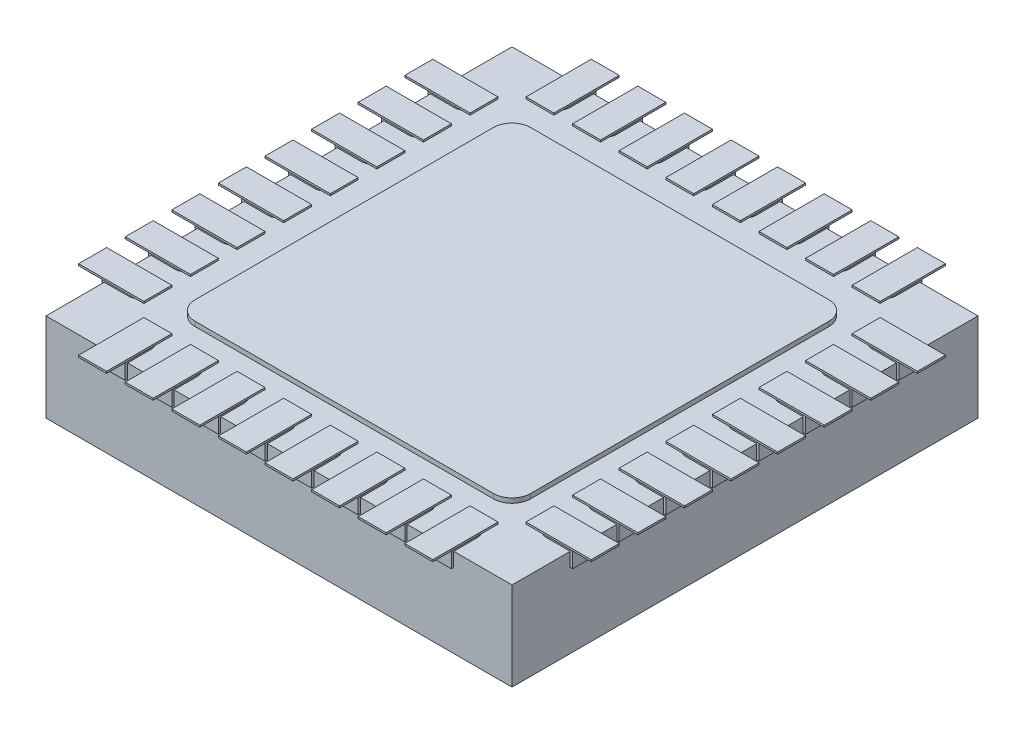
from build123d import *

# Parameters (mm, degrees)
SKETCH3_W                = 5
SKETCH3_H                = 5
BOSS_EXTRUDE2_DEPTH      = 0.95
BOSS_EXTRUDE3_DEPTH      = 0.05
BOSS_EXTRUDE3_DEPTH_BACK = 0.15
SKETCH4_W                = 0.3
SKETCH4_H                = 0.7
SKETCH4_W_2              = 0.7
SKETCH4_H_2              = 0.3
BOSS_EXTRUDE4_DEPTH      = 0.02
CUT_EXTRUDE1_DEPTH       = 0.05
CUT_EXTRUDE2_DEPTH       = 0.05
SKETCH7_R                = 0.3
CUT_EXTRUDE3_DEPTH       = 0.1


with BuildPart() as part:
    # Sketch3 → Boss-Extrude2 (new body)
    with BuildSketch(Plane(origin=(0, 0, 0), x_dir=(1, 0, 0), z_dir=(0, 1, 0))):
        Rectangle(SKETCH3_W, SKETCH3_H)
    extrude(amount=-BOSS_EXTRUDE2_DEPTH)

    # Sketch2 → Boss-Extrude3 (add, two sides: drawn at the far end of the back side and taken through both)
    with BuildSketch(Plane(origin=(0, 0, 0), x_dir=(1, 0, 0), z_dir=(0, 1, 0)).offset(-BOSS_EXTRUDE3_DEPTH_BACK)):
        with BuildLine():
            Line((-1.6, -1.8), (1.6, -1.8))
            ThreePointArc((1.6, -1.8), (1.741421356, -1.741421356), (1.8, -1.6))
            Line((1.8, -1.6), (1.8, 1.6))
            ThreePointArc((1.8, 1.6), (1.741421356, 1.741421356), (1.6, 1.8))
            Line((1.6, 1.8), (-1.6, 1.8))
            ThreePointArc((-1.6, 1.8), (-1.741421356, 1.741421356), (-1.8, 1.6))
            Line((-1.8, 1.6), (-1.8, -1.6))
            ThreePointArc((-1.8, -1.6), (-1.741421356, -1.741421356), (-1.6, -1.8))
        make_face()
        with BuildLine():
            Line((-1.875, -2.25), (-1.875, -2.525))
            Line((-1.875, -2.525), (-1.625, -2.525))
            Line((-1.625, -2.525), (-1.625, -2.25))
            ThreePointArc((-1.625, -2.25), (-1.75, -2.125), (-1.875, -2.25))
        make_face()
        with BuildLine():
            Line((-1.875, 2.25), (-1.875, 2.525))
            Line((-1.875, 2.525), (-1.625, 2.525))
            Line((-1.625, 2.525), (-1.625, 2.25))
            ThreePointArc((-1.625, 2.25), (-1.75, 2.125), (-1.875, 2.25))
        make_face()
        with BuildLine():
            Line((-1.375, -2.25), (-1.375, -2.525))
            Line((-1.375, -2.525), (-1.125, -2.525))
            Line((-1.125, -2.525), (-1.125, -2.25))
            ThreePointArc((-1.125, -2.25), (-1.25, -2.125), (-1.375, -2.25))
        make_face()
        with BuildLine():
            Line((-1.125, 2.525), (-1.125, 2.25))
            ThreePointArc((-1.125, 2.25), (-1.25, 2.125), (-1.375, 2.25))
            Line((-1.375, 2.25), (-1.375, 2.525))
            Line((-1.375, 2.525), (-1.125, 2.525))
        make_face()
        with BuildLine():
            Line((-0.875, -2.25), (-0.875, -2.525))
            Line((-0.875, -2.525), (-0.625, -2.525))
            Line((-0.625, -2.525), (-0.625, -2.25))
            ThreePointArc((-0.625, -2.25), (-0.75, -2.125), (-0.875, -2.25))
        make_face()
        with BuildLine():
            Line((-0.625, 2.525), (-0.625, 2.25))
            ThreePointArc((-0.625, 2.25), (-0.75, 2.125), (-0.875, 2.25))
            Line((-0.875, 2.25), (-0.875, 2.525))
            Line((-0.875, 2.525), (-0.625, 2.525))
        make_face()
        with BuildLine():
            Line((-0.375, -2.25), (-0.375, -2.525))
            Line((-0.375, -2.525), (-0.125, -2.525))
            Line((-0.125, -2.525), (-0.125, -2.25))
            ThreePointArc((-0.125, -2.25), (-0.25, -2.125), (-0.375, -2.25))
        make_face()
        with BuildLine():
            Line((-0.125, 2.525), (-0.125, 2.25))
            ThreePointArc((-0.125, 2.25), (-0.25, 2.125), (-0.375, 2.25))
            Line((-0.375, 2.25), (-0.375, 2.525))
            Line((-0.375, 2.525), (-0.125, 2.525))
        make_face()
        with BuildLine():
            Line((0.125, -2.25), (0.125, -2.525))
            Line((0.125, -2.525), (0.375, -2.525))
            Line((0.375, -2.525), (0.375, -2.25))
            ThreePointArc((0.375, -2.25), (0.25, -2.125), (0.125, -2.25))
        make_face()
        with BuildLine():
            Line((0.375, 2.525), (0.375, 2.25))
            ThreePointArc((0.375, 2.25), (0.25, 2.125), (0.125, 2.25))
            Line((0.125, 2.25), (0.125, 2.525))
            Line((0.125, 2.525), (0.375, 2.525))
        make_face()
        with BuildLine():
            Line((0.625, -2.25), (0.625, -2.525))
            Line((0.625, -2.525), (0.875, -2.525))
            Line((0.875, -2.525), (0.875, -2.25))
            ThreePointArc((0.875, -2.25), (0.75, -2.125), (0.625, -2.25))
        make_face()
        with BuildLine():
            Line((0.875, 2.525), (0.875, 2.25))
            ThreePointArc((0.875, 2.25), (0.75, 2.125), (0.625, 2.25))
            Line((0.625, 2.25), (0.625, 2.525))
            Line((0.625, 2.525), (0.875, 2.525))
        make_face()
        with BuildLine():
            Line((1.125, -2.25), (1.125, -2.525))
            Line((1.125, -2.525), (1.375, -2.525))
            Line((1.375, -2.525), (1.375, -2.25))
            ThreePointArc((1.375, -2.25), (1.25, -2.125), (1.125, -2.25))
        make_face()
        with BuildLine():
            Line((1.375, 2.525), (1.375, 2.25))
            ThreePointArc((1.375, 2.25), (1.25, 2.125), (1.125, 2.25))
            Line((1.125, 2.25), (1.125, 2.525))
            Line((1.125, 2.525), (1.375, 2.525))
        make_face()
        with BuildLine():
            Line((1.625, -2.25), (1.625, -2.525))
            Line((1.625, -2.525), (1.875, -2.525))
            Line((1.875, -2.525), (1.875, -2.25))
            ThreePointArc((1.875, -2.25), (1.75, -2.125), (1.625, -2.25))
        make_face()
        with BuildLine():
            Line((1.875, 2.525), (1.875, 2.25))
            ThreePointArc((1.875, 2.25), (1.75, 2.125), (1.625, 2.25))
            Line((1.625, 2.25), (1.625, 2.525))
            Line((1.625, 2.525), (1.875, 2.525))
        make_face()
        with BuildLine():
            Line((-2.525, -1.875), (-2.245, -1.875))
            ThreePointArc((-2.245, -1.875), (-2.12, -1.75), (-2.245, -1.625))
            Line((-2.245, -1.625), (-2.525, -1.625))
            Line((-2.525, -1.625), (-2.525, -1.875))
        make_face()
        with BuildLine():
            Line((2.245, -1.875), (2.525, -1.875))
            Line((2.525, -1.875), (2.525, -1.625))
            Line((2.525, -1.625), (2.245, -1.625))
            ThreePointArc((2.245, -1.625), (2.12, -1.75), (2.245, -1.875))
        make_face()
        with BuildLine():
            Line((-2.245, -1.125), (-2.525, -1.125))
            Line((-2.525, -1.125), (-2.525, -1.375))
            Line((-2.525, -1.375), (-2.245, -1.375))
            ThreePointArc((-2.245, -1.375), (-2.12, -1.25), (-2.245, -1.125))
        make_face()
        with BuildLine():
            Line((2.245, -1.375), (2.525, -1.375))
            Line((2.525, -1.375), (2.525, -1.125))
            Line((2.525, -1.125), (2.245, -1.125))
            ThreePointArc((2.245, -1.125), (2.12, -1.25), (2.245, -1.375))
        make_face()
        with BuildLine():
            Line((-2.245, -0.625), (-2.525, -0.625))
            Line((-2.525, -0.625), (-2.525, -0.875))
            Line((-2.525, -0.875), (-2.245, -0.875))
            ThreePointArc((-2.245, -0.875), (-2.12, -0.75), (-2.245, -0.625))
        make_face()
        with BuildLine():
            Line((2.245, -0.875), (2.525, -0.875))
            Line((2.525, -0.875), (2.525, -0.625))
            Line((2.525, -0.625), (2.245, -0.625))
            ThreePointArc((2.245, -0.625), (2.12, -0.75), (2.245, -0.875))
        make_face()
        with BuildLine():
            Line((-2.245, -0.125), (-2.525, -0.125))
            Line((-2.525, -0.125), (-2.525, -0.375))
            Line((-2.525, -0.375), (-2.245, -0.375))
            ThreePointArc((-2.245, -0.375), (-2.12, -0.25), (-2.245, -0.125))
        make_face()
        with BuildLine():
            Line((2.245, -0.375), (2.525, -0.375))
            Line((2.525, -0.375), (2.525, -0.125))
            Line((2.525, -0.125), (2.245, -0.125))
            ThreePointArc((2.245, -0.125), (2.12, -0.25), (2.245, -0.375))
        make_face()
        with BuildLine():
            Line((-2.245, 0.375), (-2.525, 0.375))
            Line((-2.525, 0.375), (-2.525, 0.125))
            Line((-2.525, 0.125), (-2.245, 0.125))
            ThreePointArc((-2.245, 0.125), (-2.12, 0.25), (-2.245, 0.375))
        make_face()
        with BuildLine():
            Line((2.245, 0.125), (2.525, 0.125))
            Line((2.525, 0.125), (2.525, 0.375))
            Line((2.525, 0.375), (2.245, 0.375))
            ThreePointArc((2.245, 0.375), (2.12, 0.25), (2.245, 0.125))
        make_face()
        with BuildLine():
            Line((-2.245, 0.875), (-2.525, 0.875))
            Line((-2.525, 0.875), (-2.525, 0.625))
            Line((-2.525, 0.625), (-2.245, 0.625))
            ThreePointArc((-2.245, 0.625), (-2.12, 0.75), (-2.245, 0.875))
        make_face()
        with BuildLine():
            Line((2.245, 0.625), (2.525, 0.625))
            Line((2.525, 0.625), (2.525, 0.875))
            Line((2.525, 0.875), (2.245, 0.875))
            ThreePointArc((2.245, 0.875), (2.12, 0.75), (2.245, 0.625))
        make_face()
        with BuildLine():
            Line((-2.245, 1.375), (-2.525, 1.375))
            Line((-2.525, 1.375), (-2.525, 1.125))
            Line((-2.525, 1.125), (-2.245, 1.125))
            ThreePointArc((-2.245, 1.125), (-2.12, 1.25), (-2.245, 1.375))
        make_face()
        with BuildLine():
            Line((2.245, 1.125), (2.525, 1.125))
            Line((2.525, 1.125), (2.525, 1.375))
            Line((2.525, 1.375), (2.245, 1.375))
            ThreePointArc((2.245, 1.375), (2.12, 1.25), (2.245, 1.125))
        make_face()
        with BuildLine():
            Line((-2.245, 1.875), (-2.525, 1.875))
            Line((-2.525, 1.875), (-2.525, 1.625))
            Line((-2.525, 1.625), (-2.245, 1.625))
            ThreePointArc((-2.245, 1.625), (-2.12, 1.75), (-2.245, 1.875))
        make_face()
        with BuildLine():
            Line((2.245, 1.625), (2.525, 1.625))
            Line((2.525, 1.625), (2.525, 1.875))
            Line((2.525, 1.875), (2.245, 1.875))
            ThreePointArc((2.245, 1.875), (2.12, 1.75), (2.245, 1.625))
        make_face()
    extrude(amount=BOSS_EXTRUDE3_DEPTH + BOSS_EXTRUDE3_DEPTH_BACK)

    # Sketch4 → Boss-Extrude4 (add)
    with BuildSketch(Plane(origin=(0, 0.06, 0), x_dir=(1, 0, 0), z_dir=(0, 1, 0))):
        with Locations((-1.75, 2.4)):
            Rectangle(SKETCH4_W, SKETCH4_H)
        with Locations((-1.75, -2.4)):
            Rectangle(SKETCH4_W, SKETCH4_H)
        with Locations((-1.25, -2.4)):
            Rectangle(SKETCH4_W, SKETCH4_H)
        with Locations((-1.25, 2.4)):
            Rectangle(SKETCH4_W, SKETCH4_H)
        with Locations((-0.75, -2.4)):
            Rectangle(SKETCH4_W, SKETCH4_H)
        with Locations((-0.75, 2.4)):
            Rectangle(SKETCH4_W, SKETCH4_H)
        with Locations((-0.25, -2.4)):
            Rectangle(SKETCH4_W, SKETCH4_H)
        with Locations((-0.25, 2.4)):
            Rectangle(SKETCH4_W, SKETCH4_H)
        with Locations((0.25, -2.4)):
            Rectangle(SKETCH4_W, SKETCH4_H)
        with Locations((0.25, 2.4)):
            Rectangle(SKETCH4_W, SKETCH4_H)
        with Locations((0.75, -2.4)):
            Rectangle(SKETCH4_W, SKETCH4_H)
        with Locations((0.75, 2.4)):
            Rectangle(SKETCH4_W, SKETCH4_H)
        with Locations((1.25, -2.4)):
            Rectangle(SKETCH4_W, SKETCH4_H)
        with Locations((1.25, 2.4)):
            Rectangle(SKETCH4_W, SKETCH4_H)
        with Locations((1.75, -2.4)):
            Rectangle(SKETCH4_W, SKETCH4_H)
        with Locations((1.75, 2.4)):
            Rectangle(SKETCH4_W, SKETCH4_H)
        with Locations((-2.4, 1.25)):
            Rectangle(SKETCH4_W_2, SKETCH4_H_2)
        with Locations((-2.4, 1.75)):
            Rectangle(SKETCH4_W_2, SKETCH4_H_2)
        with Locations((2.4, 1.75)):
            Rectangle(SKETCH4_W_2, SKETCH4_H_2)
        with Locations((2.4, 1.25)):
            Rectangle(SKETCH4_W_2, SKETCH4_H_2)
        with Locations((-2.4, 0.75)):
            Rectangle(SKETCH4_W_2, SKETCH4_H_2)
        with Locations((2.4, 0.75)):
            Rectangle(SKETCH4_W_2, SKETCH4_H_2)
        with Locations((-2.4, 0.25)):
            Rectangle(SKETCH4_W_2, SKETCH4_H_2)
        with Locations((2.4, 0.25)):
            Rectangle(SKETCH4_W_2, SKETCH4_H_2)
        with Locations((-2.4, -0.25)):
            Rectangle(SKETCH4_W_2, SKETCH4_H_2)
        with Locations((2.4, -0.25)):
            Rectangle(SKETCH4_W_2, SKETCH4_H_2)
        with Locations((-2.4, -0.75)):
            Rectangle(SKETCH4_W_2, SKETCH4_H_2)
        with Locations((2.4, -0.75)):
            Rectangle(SKETCH4_W_2, SKETCH4_H_2)
        with Locations((-2.4, -1.25)):
            Rectangle(SKETCH4_W_2, SKETCH4_H_2)
        with Locations((2.4, -1.25)):
            Rectangle(SKETCH4_W_2, SKETCH4_H_2)
        with Locations((-2.4, -1.75)):
            Rectangle(SKETCH4_W_2, SKETCH4_H_2)
        with Locations((2.4, -1.75)):
            Rectangle(SKETCH4_W_2, SKETCH4_H_2)
    extrude(amount=-BOSS_EXTRUDE4_DEPTH)

    # Sketch6 → Cut-Extrude1 (cut)
    # profile 1 of 20: a face of its own
    with BuildSketch(Plane.XZ.offset(0.95)):
        with BuildLine():
            Line((1.210072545, -0.426367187), (1.064592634, -0.012639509))
            Line((1.064592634, -0.012639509), (1.062751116, -0.014890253))
            Line((1.062751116, -0.014890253), (0.916145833, -0.431687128))
            add(Edge.make_bspline(
                [(0.916145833, -0.431687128), (0.914718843, -0.433195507), (0.911946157, -0.436126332), (0.907954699, -0.436650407), (0.906017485, -0.436904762)],
                knots=[0, 0, 0, 0, 1.029320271, 2, 2, 2, 2], degree=3))
            add(Edge.make_bspline(
                [(0.906017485, -0.436904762), (0.905154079, -0.436892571), (0.903713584, -0.436872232), (0.902363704, -0.43638415), (0.901822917, -0.436188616)],
                knots=[0, 0, 0, 0, 1.198762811, 2, 2, 2, 2], degree=3))
            add(Edge.make_bspline(
                [(0.901822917, -0.436188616), (0.900869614, -0.435761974), (0.899028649, -0.434938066), (0.896791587, -0.432829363), (0.894994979, -0.430273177), (0.894369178, -0.42823363), (0.894047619, -0.42718564)],
                knots=[0, 0, 0, 0, 1.006089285, 1.94290214, 2.942991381, 4, 4, 4, 4], degree=3))
            Line((0.894047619, -0.42718564), (0.894047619, -0.409281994))
            Line((0.894047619, -0.409281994), (0.894047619, 0.101841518))
            add(Edge.make_bspline(
                [(0.894047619, 0.101841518), (0.894307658, 0.103015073), (0.894815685, 0.105307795), (0.896366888, 0.108472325), (0.898698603, 0.11106287), (0.900568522, 0.112411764), (0.901515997, 0.113095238)],
                knots=[0, 0, 0, 0, 1.032778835, 2.01769381, 2.995579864, 4, 4, 4, 4], degree=3))
            Line((0.901515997, 0.113095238), (0.931184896, 0.113095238))
            add(Edge.make_bspline(
                [(0.931184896, 0.113095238), (0.93199492, 0.112801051), (0.933652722, 0.112198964), (0.935716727, 0.110358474), (0.937393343, 0.107873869), (0.93821062, 0.105951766), (0.938653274, 0.104910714)],
                knots=[0, 0, 0, 0, 0.892106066, 1.825791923, 2.822403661, 4, 4, 4, 4], degree=3))
            Line((0.938653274, 0.104910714), (0.939880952, 0.097544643))
            Line((0.939880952, 0.097544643), (0.939880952, -0.218480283))
            Line((0.939880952, -0.218480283), (1.053952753, 0.106445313))
            add(Edge.make_bspline(
                [(1.053952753, 0.106445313), (1.05474302, 0.107424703), (1.05623294, 0.109271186), (1.058784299, 0.11152962), (1.061650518, 0.112842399), (1.063626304, 0.113012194), (1.064592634, 0.113095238)],
                knots=[0, 0, 0, 0, 1.158246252, 2.183685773, 3.111665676, 4, 4, 4, 4], degree=3))
            add(Edge.make_bspline(
                [(1.064592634, 0.113095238), (1.065983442, 0.112994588), (1.068713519, 0.112797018), (1.072411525, 0.110659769), (1.075254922, 0.107188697), (1.076372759, 0.104306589), (1.076971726, 0.102762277)],
                knots=[0, 0, 0, 0, 0.953966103, 1.872582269, 2.860071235, 4, 4, 4, 4], degree=3))
            Line((1.076971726, 0.102762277), (1.188690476, -0.218480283))
            Line((1.188690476, -0.218480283), (1.188690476, 0.102762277))
            add(Edge.make_bspline(
                [(1.188690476, 0.102762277), (1.189515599, 0.104678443), (1.191023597, 0.108180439), (1.194976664, 0.111207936), (1.19868678, 0.112141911), (1.202132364, 0.112803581), (1.206318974, 0.113032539), (1.209356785, 0.113073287), (1.210993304, 0.113095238)],
                knots=[0, 0, 0, 0, 1.387598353, 2.535982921, 3.182758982, 3.953118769, 4.897311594, 6, 6, 6, 6], degree=3))
            Line((1.210993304, 0.113095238), (1.226441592, 0.113095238))
            add(Edge.make_bspline(
                [(1.226441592, 0.113095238), (1.228061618, 0.112005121), (1.231683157, 0.109568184), (1.233512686, 0.105580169), (1.23452381, 0.103376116)],
                knots=[0, 0, 0, 0, 0.894661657, 2, 2, 2, 2], degree=3))
            Line((1.23452381, 0.103376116), (1.23452381, 0.090690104))
            Line((1.23452381, 0.090690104), (1.23452381, -0.424934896))
            add(Edge.make_bspline(
                [(1.23452381, -0.424934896), (1.234132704, -0.42621927), (1.23340636, -0.428604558), (1.231610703, -0.431654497), (1.229471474, -0.434067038), (1.227637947, -0.434944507), (1.226748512, -0.435370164)],
                knots=[0, 0, 0, 0, 1.189307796, 2.20873289, 3.131064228, 4, 4, 4, 4], degree=3))
            add(Edge.make_bspline(
                [(1.226748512, -0.435370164), (1.225947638, -0.435805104), (1.224288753, -0.436706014), (1.222403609, -0.436837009), (1.221428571, -0.436904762)],
                knots=[0, 0, 0, 0, 0.965557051, 2, 2, 2, 2], degree=3))
            add(Edge.make_bspline(
                [(1.221428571, -0.436904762), (1.220449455, -0.436771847), (1.218455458, -0.436501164), (1.215589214, -0.434531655), (1.212907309, -0.430995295), (1.211129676, -0.428093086), (1.210072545, -0.426367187)],
                knots=[0, 0, 0, 0, 0.724309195, 1.475075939, 2.498466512, 4, 4, 4, 4], degree=3))
        make_face()
    # profile 2 of 20: a face of its own
    with BuildSketch(Plane.XZ.offset(0.95)):
        with BuildLine():
            add(Edge.make_bspline(
                [(0.510500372, -0.43608631), (0.50976656, -0.43600872), (0.508290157, -0.435852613), (0.506287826, -0.434471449), (0.504930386, -0.432181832), (0.503286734, -0.427891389), (0.502406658, -0.420663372), (0.502283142, -0.414496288), (0.502213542, -0.411021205)],
                knots=[0, 0, 0, 0, 0.458930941, 0.92335228, 1.465177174, 2.111000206, 3.808592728, 6, 6, 6, 6], degree=3))
            Line((0.502213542, -0.411021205), (0.502213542, -0.390559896))
            add(Edge.make_bspline(
                [(0.502213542, -0.390559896), (0.502871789, -0.388157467), (0.504087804, -0.383719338), (0.507642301, -0.38083417), (0.509272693, -0.379510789)],
                knots=[0, 0, 0, 0, 1.082630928, 2, 2, 2, 2], degree=3))
            Line((0.509272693, -0.379510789), (0.515206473, -0.37797619))
            Line((0.515206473, -0.37797619), (0.717261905, -0.37797619))
            Line((0.717261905, -0.37797619), (0.717261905, -0.188095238))
            Line((0.717261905, -0.188095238), (0.609123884, -0.188095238))
            add(Edge.make_bspline(
                [(0.609123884, -0.188095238), (0.608410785, -0.187874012), (0.606831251, -0.18738399), (0.60498413, -0.185327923), (0.603044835, -0.182693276), (0.602023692, -0.180517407), (0.601450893, -0.179296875)],
                knots=[0, 0, 0, 0, 0.730957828, 1.619092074, 2.664453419, 4, 4, 4, 4], degree=3))
            add(Edge.make_bspline(
                [(0.601450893, -0.179296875), (0.601261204, -0.178105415), (0.600840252, -0.17546135), (0.600614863, -0.171079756), (0.600390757, -0.165931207), (0.60034831, -0.16224623), (0.600325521, -0.160267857)],
                knots=[0, 0, 0, 0, 0.758257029, 1.682708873, 2.755903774, 4, 4, 4, 4], degree=3))
            add(Edge.make_bspline(
                [(0.600325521, -0.160267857), (0.600321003, -0.157948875), (0.600312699, -0.153685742), (0.600363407, -0.147920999), (0.60065606, -0.143350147), (0.600693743, -0.138942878), (0.60241447, -0.134012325), (0.605672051, -0.131909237), (0.607384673, -0.130803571)],
                knots=[0, 0, 0, 0, 1.303816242, 2.396889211, 3.2414061, 3.875301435, 4.882973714, 6, 6, 6, 6], degree=3))
            Line((0.607384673, -0.130803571), (0.613216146, -0.129166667))
            Line((0.613216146, -0.129166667), (0.717261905, -0.129166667))
            Line((0.717261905, -0.129166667), (0.717261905, 0.054166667))
            Line((0.717261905, 0.054166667), (0.510500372, 0.054166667))
            add(Edge.make_bspline(
                [(0.510500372, 0.054166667), (0.509582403, 0.054632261), (0.507712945, 0.055580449), (0.505452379, 0.057901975), (0.503732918, 0.060930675), (0.503144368, 0.063250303), (0.502827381, 0.064499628)],
                knots=[0, 0, 0, 0, 0.916389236, 1.866239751, 2.850781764, 4, 4, 4, 4], degree=3))
            add(Edge.make_bspline(
                [(0.502827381, 0.064499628), (0.502705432, 0.066749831), (0.502432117, 0.071793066), (0.502469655, 0.080154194), (0.502131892, 0.090108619), (0.502184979, 0.09727146), (0.502213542, 0.101125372)],
                knots=[0, 0, 0, 0, 0.737996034, 1.654022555, 2.737764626, 4, 4, 4, 4], degree=3))
            add(Edge.make_bspline(
                [(0.502213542, 0.101125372), (0.502995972, 0.103481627), (0.504390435, 0.107680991), (0.507427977, 0.110874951), (0.508761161, 0.112276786)],
                knots=[0, 0, 0, 0, 1.122196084, 2, 2, 2, 2], degree=3))
            Line((0.508761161, 0.112276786), (0.512955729, 0.113095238))
            Line((0.512955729, 0.113095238), (0.75531994, 0.113095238))
            add(Edge.make_bspline(
                [(0.75531994, 0.113095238), (0.756910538, 0.112005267), (0.76046562, 0.109569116), (0.762159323, 0.105580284), (0.763095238, 0.103376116)],
                knots=[0, 0, 0, 0, 0.894830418, 2, 2, 2, 2], degree=3))
            Line((0.763095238, 0.103376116), (0.763095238, 0.090690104))
            Line((0.763095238, 0.090690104), (0.763095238, -0.425651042))
            add(Edge.make_bspline(
                [(0.763095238, -0.425651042), (0.762754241, -0.426940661), (0.76208983, -0.429453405), (0.759961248, -0.432695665), (0.757091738, -0.435267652), (0.754775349, -0.436347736), (0.753580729, -0.436904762)],
                knots=[0, 0, 0, 0, 1.034608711, 2.015872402, 2.976736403, 4, 4, 4, 4], degree=3))
            Line((0.753580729, -0.436904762), (0.510500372, -0.43608631))
        make_face()
    # profile 3 of 20: a face of its own
    with BuildSketch(Plane.XZ.offset(0.95)):
        with BuildLine():
            Line((0.151302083, -0.40733817), (0.109561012, -0.353422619))
            Line((0.109561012, -0.353422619), (0.088690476, -0.29797247))
            add(Edge.make_bspline(
                [(0.088690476, -0.29797247), (0.088708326, -0.295342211), (0.08873854, -0.290889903), (0.090374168, -0.286768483), (0.091043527, -0.285081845)],
                knots=[0, 0, 0, 0, 1.181526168, 2, 2, 2, 2], degree=3))
            add(Edge.make_bspline(
                [(0.091043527, -0.285081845), (0.091989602, -0.284044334), (0.093837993, -0.282017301), (0.097377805, -0.279791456), (0.101446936, -0.278410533), (0.10436592, -0.278289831), (0.105877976, -0.278227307)],
                knots=[0, 0, 0, 0, 0.991719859, 1.937568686, 2.931644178, 4, 4, 4, 4], degree=3))
            add(Edge.make_bspline(
                [(0.105877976, -0.278227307), (0.106867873, -0.278285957), (0.109572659, -0.278446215), (0.114197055, -0.279091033), (0.119558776, -0.279756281), (0.123987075, -0.280205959), (0.127274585, -0.281044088), (0.129255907, -0.282738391), (0.130923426, -0.285057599), (0.131667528, -0.286934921), (0.132068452, -0.287946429)],
                knots=[0, 0, 0, 0, 0.792010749, 2.164084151, 3.728773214, 5.104358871, 5.733381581, 6.392937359, 7.134108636, 8, 8, 8, 8], degree=3))
            Line((0.132068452, -0.287946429), (0.149869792, -0.334802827))
            Line((0.149869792, -0.334802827), (0.16889881, -0.357105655))
            Line((0.16889881, -0.357105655), (0.202762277, -0.37797619))
            Line((0.202762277, -0.37797619), (0.275195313, -0.37797619))
            Line((0.275195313, -0.37797619), (0.310184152, -0.355877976))
            Line((0.310184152, -0.355877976), (0.327473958, -0.333779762))
            add(Edge.make_bspline(
                [(0.327473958, -0.333779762), (0.32889894, -0.330619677), (0.33193553, -0.323885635), (0.33620276, -0.312881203), (0.340541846, -0.300442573), (0.345090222, -0.286617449), (0.349503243, -0.271323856), (0.35428068, -0.254684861), (0.35891103, -0.236536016), (0.362058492, -0.223971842), (0.363690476, -0.217457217)],
                knots=[0, 0, 0, 0, 0.681852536, 1.453006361, 2.320821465, 3.273390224, 4.315664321, 5.451898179, 6.67878895, 8, 8, 8, 8], degree=3))
            Line((0.363690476, -0.217457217), (0.363690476, -0.101953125))
            add(Edge.make_bspline(
                [(0.363690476, -0.101953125), (0.362597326, -0.098031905), (0.360535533, -0.090636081), (0.357649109, -0.080172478), (0.3551912, -0.070922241), (0.353095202, -0.062928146), (0.351213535, -0.056186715), (0.349673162, -0.050707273), (0.348543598, -0.046444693), (0.347965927, -0.04401437), (0.347730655, -0.043024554)],
                knots=[0, 0, 0, 0, 1.60019962, 3.018140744, 4.266793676, 5.362603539, 6.266752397, 7.018056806, 7.600076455, 8, 8, 8, 8], degree=3))
            add(Edge.make_bspline(
                [(0.347730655, -0.043024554), (0.345991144, -0.037795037), (0.342620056, -0.027660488), (0.337159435, -0.013105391), (0.331710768, 0.000357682), (0.327810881, 0.008857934), (0.32593936, 0.012937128)],
                knots=[0, 0, 0, 0, 1.100461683, 2.132641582, 3.103871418, 4, 4, 4, 4], degree=3))
            Line((0.32593936, 0.012937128), (0.30875186, 0.033603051))
            Line((0.30875186, 0.033603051), (0.274479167, 0.054166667))
            Line((0.274479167, 0.054166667), (0.203069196, 0.054166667))
            Line((0.203069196, 0.054166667), (0.167568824, 0.032375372))
            Line((0.167568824, 0.032375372), (0.15109747, 0.010481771))
            Line((0.15109747, 0.010481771), (0.13452381, -0.030952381))
            Line((0.13452381, -0.030952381), (0.13452381, -0.083333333))
            Line((0.13452381, -0.083333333), (0.20327381, -0.083333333))
            add(Edge.make_bspline(
                [(0.20327381, -0.083333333), (0.205071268, -0.08423417), (0.208562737, -0.085984), (0.210236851, -0.089503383), (0.211049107, -0.091210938)],
                knots=[0, 0, 0, 0, 1.029628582, 2, 2, 2, 2], degree=3))
            Line((0.211049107, -0.091210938), (0.212788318, -0.095917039))
            Line((0.212788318, -0.095917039), (0.212174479, -0.130496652))
            add(Edge.make_bspline(
                [(0.212174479, -0.130496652), (0.211845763, -0.131707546), (0.21123244, -0.133966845), (0.20965754, -0.136948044), (0.207612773, -0.139303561), (0.20586525, -0.140260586), (0.205013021, -0.140727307)],
                knots=[0, 0, 0, 0, 1.16021269, 2.164737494, 3.104982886, 4, 4, 4, 4], degree=3))
            Line((0.205013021, -0.140727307), (0.198976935, -0.142261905))
            Line((0.198976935, -0.142261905), (0.097693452, -0.142261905))
            add(Edge.make_bspline(
                [(0.097693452, -0.142261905), (0.095697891, -0.141171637), (0.091891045, -0.139091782), (0.090138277, -0.135139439), (0.089304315, -0.133258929)],
                knots=[0, 0, 0, 0, 1.048407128, 2, 2, 2, 2], degree=3))
            Line((0.089304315, -0.133258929), (0.088690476, -0.124972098))
            Line((0.088690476, -0.124972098), (0.088690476, -0.022051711))
            Line((0.088690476, -0.022051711), (0.11140253, 0.03421689))
            Line((0.11140253, 0.03421689), (0.153655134, 0.08608631))
            Line((0.153655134, 0.08608631), (0.196623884, 0.113095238))
            Line((0.196623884, 0.113095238), (0.282459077, 0.113095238))
            Line((0.282459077, 0.113095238), (0.326655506, 0.08547247))
            Line((0.326655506, 0.08547247), (0.369010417, 0.031659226))
            Line((0.369010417, 0.031659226), (0.390392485, -0.024404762))
            Line((0.390392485, -0.024404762), (0.40952381, -0.09765625))
            Line((0.40952381, -0.09765625), (0.40952381, -0.227687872))
            Line((0.40952381, -0.227687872), (0.388039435, -0.306156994))
            Line((0.388039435, -0.306156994), (0.367782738, -0.356184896))
            Line((0.367782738, -0.356184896), (0.323688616, -0.40999814))
            Line((0.323688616, -0.40999814), (0.282459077, -0.436188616))
            Line((0.282459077, -0.436188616), (0.279492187, -0.436904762))
            Line((0.279492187, -0.436904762), (0.195396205, -0.436188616))
            Line((0.195396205, -0.436188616), (0.151302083, -0.40733817))
        make_face()
    # profile 4 of 20: a face of its own
    with BuildSketch(Plane.XZ.offset(0.95)):
        with BuildLine():
            Line((-0.165745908, -0.42718564), (-0.323809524, 0.095191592))
            add(Edge.make_bspline(
                [(-0.323809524, 0.095191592), (-0.323778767, 0.096695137), (-0.323721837, 0.099478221), (-0.323103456, 0.103329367), (-0.322163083, 0.106522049), (-0.320645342, 0.109085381), (-0.318504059, 0.11104534), (-0.315539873, 0.11221671), (-0.311922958, 0.11307283), (-0.309220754, 0.113087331), (-0.307747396, 0.113095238)],
                knots=[0, 0, 0, 0, 1.274690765, 2.359471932, 3.302146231, 4.081389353, 4.860094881, 5.715183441, 6.754219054, 8, 8, 8, 8], degree=3))
            Line((-0.307747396, 0.113095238), (-0.288002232, 0.113095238))
            add(Edge.make_bspline(
                [(-0.288002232, 0.113095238), (-0.286470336, 0.112170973), (-0.283233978, 0.110218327), (-0.281331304, 0.106942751), (-0.280329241, 0.105217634)],
                knots=[0, 0, 0, 0, 0.946678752, 2, 2, 2, 2], degree=3))
            Line((-0.280329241, 0.105217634), (-0.245135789, -0.004761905))
            Line((-0.245135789, -0.004761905), (-0.062620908, -0.004761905))
            Line((-0.062620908, -0.004761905), (-0.026302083, 0.106752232))
            add(Edge.make_bspline(
                [(-0.026302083, 0.106752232), (-0.025461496, 0.107724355), (-0.023755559, 0.109697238), (-0.020325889, 0.111714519), (-0.016316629, 0.112882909), (-0.013488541, 0.113021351), (-0.011979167, 0.113095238)],
                knots=[0, 0, 0, 0, 0.943850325, 1.915505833, 2.887487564, 4, 4, 4, 4], degree=3))
            add(Edge.make_bspline(
                [(-0.011979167, 0.113095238), (-0.010853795, 0.113095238), (-0.008057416, 0.113095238), (-0.005261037, 0.113095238), (-0.00359003, 0.113095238)],
                knots=[0, 0, 0, 0, 0.804878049, 2, 2, 2, 2], degree=3))
            add(Edge.make_bspline(
                [(-0.00359003, 0.113095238), (-0.001543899, 0.113095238), (0.002241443, 0.113095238), (0.006026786, 0.113095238), (0.007765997, 0.113095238)],
                knots=[0, 0, 0, 0, 1.081081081, 2, 2, 2, 2], degree=3))
            add(Edge.make_bspline(
                [(0.007765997, 0.113095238), (0.009131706, 0.112703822), (0.011822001, 0.111932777), (0.014799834, 0.108491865), (0.016516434, 0.103768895), (0.016613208, 0.100154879), (0.016666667, 0.098158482)],
                knots=[0, 0, 0, 0, 0.879221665, 1.731968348, 2.747130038, 4, 4, 4, 4], degree=3))
            add(Edge.make_bspline(
                [(0.016666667, 0.098158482), (0.016679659, 0.097061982), (0.016703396, 0.095058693), (0.016255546, 0.093107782), (0.016052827, 0.092224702)],
                knots=[0, 0, 0, 0, 1.094700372, 2, 2, 2, 2], degree=3))
            Line((0.016052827, 0.092224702), (-0.143136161, -0.429436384))
            add(Edge.make_bspline(
                [(-0.143136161, -0.429436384), (-0.143808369, -0.430559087), (-0.14505183, -0.432635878), (-0.147399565, -0.435066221), (-0.149985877, -0.436540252), (-0.151782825, -0.436786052), (-0.15265067, -0.436904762)],
                knots=[0, 0, 0, 0, 1.238763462, 2.291482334, 3.174862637, 4, 4, 4, 4], degree=3))
            add(Edge.make_bspline(
                [(-0.15265067, -0.436904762), (-0.154074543, -0.436799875), (-0.156850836, -0.436595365), (-0.160594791, -0.434572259), (-0.163752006, -0.431441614), (-0.165047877, -0.428675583), (-0.165745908, -0.42718564)],
                knots=[0, 0, 0, 0, 0.976753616, 1.904492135, 2.87123923, 4, 4, 4, 4], degree=3))
        make_face()
        Polygon((-0.080217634, -0.063690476), (-0.22641369, -0.063690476), (-0.153366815, -0.299813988), align=None, mode=Mode.SUBTRACT)
    # profile 5 of 20: a face of its own
    with BuildSketch(Plane.XZ.offset(0.95)):
        with BuildLine():
            add(Edge.make_bspline(
                [(-0.581212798, -0.432096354), (-0.582524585, -0.430253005), (-0.585306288, -0.4263441), (-0.585573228, -0.421539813), (-0.585714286, -0.419001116)],
                knots=[0, 0, 0, 0, 0.943153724, 2, 2, 2, 2], degree=3))
            Line((-0.585714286, -0.419001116), (-0.585714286, 0.10265997))
            add(Edge.make_bspline(
                [(-0.585714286, 0.10265997), (-0.584969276, 0.104930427), (-0.583556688, 0.109235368), (-0.5798808, 0.111856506), (-0.578143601, 0.113095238)],
                knots=[0, 0, 0, 0, 1.05481425, 2, 2, 2, 2], degree=3))
            Line((-0.578143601, 0.113095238), (-0.548065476, 0.113095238))
            add(Edge.make_bspline(
                [(-0.548065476, 0.113095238), (-0.547083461, 0.112665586), (-0.545145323, 0.11181761), (-0.542687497, 0.109685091), (-0.540934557, 0.106806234), (-0.540243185, 0.104622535), (-0.539880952, 0.103478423)],
                knots=[0, 0, 0, 0, 0.972168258, 1.918702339, 2.909539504, 4, 4, 4, 4], degree=3))
            Line((-0.539880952, 0.103478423), (-0.539880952, 0.088643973))
            Line((-0.539880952, 0.088643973), (-0.539880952, -0.330403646))
            Line((-0.539880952, -0.330403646), (-0.519828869, -0.305747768))
            Line((-0.519828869, -0.305747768), (-0.476655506, -0.279659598))
            add(Edge.make_bspline(
                [(-0.476655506, -0.279659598), (-0.475357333, -0.279727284), (-0.472976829, -0.279851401), (-0.469639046, -0.280521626), (-0.466937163, -0.281870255), (-0.464594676, -0.283873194), (-0.463005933, -0.287323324), (-0.462070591, -0.292264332), (-0.461346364, -0.299010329), (-0.461322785, -0.304108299), (-0.461309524, -0.306975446)],
                knots=[0, 0, 0, 0, 0.853787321, 1.565619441, 2.216715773, 2.819394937, 3.550694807, 4.653687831, 6.118001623, 8, 8, 8, 8], degree=3))
            Line((-0.461309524, -0.306975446), (-0.461309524, -0.315364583))
            add(Edge.make_bspline(
                [(-0.461309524, -0.315364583), (-0.461375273, -0.317555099), (-0.461496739, -0.321601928), (-0.462660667, -0.327063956), (-0.464670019, -0.331488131), (-0.466832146, -0.333459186), (-0.467857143, -0.334393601)],
                knots=[0, 0, 0, 0, 1.260445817, 2.328588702, 3.207636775, 4, 4, 4, 4], degree=3))
            Line((-0.467857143, -0.334393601), (-0.506119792, -0.358640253))
            Line((-0.506119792, -0.358640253), (-0.566582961, -0.434654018))
            add(Edge.make_bspline(
                [(-0.566582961, -0.434654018), (-0.567332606, -0.435284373), (-0.569032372, -0.436713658), (-0.571267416, -0.436836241), (-0.572516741, -0.436904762)],
                knots=[0, 0, 0, 0, 0.882057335, 2, 2, 2, 2], degree=3))
            add(Edge.make_bspline(
                [(-0.572516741, -0.436904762), (-0.574010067, -0.436612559), (-0.577398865, -0.435949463), (-0.579844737, -0.433478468), (-0.581212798, -0.432096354)],
                knots=[0, 0, 0, 0, 0.881330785, 2, 2, 2, 2], degree=3))
        make_face()
    # profile 6 of 20: a face of its own
    with BuildSketch(Plane.XZ.offset(0.95)):
        with BuildLine():
            Line((-1.043024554, -0.409384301), (-1.048446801, -0.403245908))
            Line((-1.048446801, -0.403245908), (-1.06860119, -0.349637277))
            add(Edge.make_bspline(
                [(-1.06860119, -0.349637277), (-1.068755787, -0.348923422), (-1.069142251, -0.347138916), (-1.069187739, -0.345311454), (-1.06921503, -0.34421503)],
                knots=[0, 0, 0, 0, 0.800058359, 2, 2, 2, 2], degree=3))
            add(Edge.make_bspline(
                [(-1.06921503, -0.34421503), (-1.069150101, -0.342667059), (-1.069017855, -0.339514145), (-1.067995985, -0.336527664), (-1.067475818, -0.33500744)],
                knots=[0, 0, 0, 0, 0.981930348, 2, 2, 2, 2], degree=3))
            add(Edge.make_bspline(
                [(-1.067475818, -0.33500744), (-1.066643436, -0.333958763), (-1.064975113, -0.331856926), (-1.061485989, -0.329780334), (-1.057531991, -0.328300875), (-1.054669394, -0.328204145), (-1.053152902, -0.328152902)],
                knots=[0, 0, 0, 0, 0.96489623, 1.933918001, 2.905469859, 4, 4, 4, 4], degree=3))
            add(Edge.make_bspline(
                [(-1.053152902, -0.328152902), (-1.052163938, -0.328152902), (-1.049401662, -0.328152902), (-1.046639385, -0.328152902), (-1.044866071, -0.328152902)],
                knots=[0, 0, 0, 0, 0.716049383, 2, 2, 2, 2], degree=3))
            add(Edge.make_bspline(
                [(-1.044866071, -0.328152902), (-1.042821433, -0.328347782), (-1.039043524, -0.328707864), (-1.035250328, -0.328818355), (-1.033510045, -0.328869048)],
                knots=[0, 0, 0, 0, 1.082418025, 2, 2, 2, 2], degree=3))
            add(Edge.make_bspline(
                [(-1.033510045, -0.328869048), (-1.032526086, -0.329478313), (-1.030493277, -0.330737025), (-1.027831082, -0.333549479), (-1.025688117, -0.33728438), (-1.02304197, -0.343139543), (-1.020082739, -0.350829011), (-1.0179721, -0.357098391), (-1.016936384, -0.360174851)],
                knots=[0, 0, 0, 0, 0.574329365, 1.186534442, 1.902625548, 2.707546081, 4.384353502, 6, 6, 6, 6], degree=3))
            Line((-1.016936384, -0.360174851), (-0.976525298, -0.37797619))
            Line((-0.976525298, -0.37797619), (-0.939592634, -0.37797619))
            Line((-0.939592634, -0.37797619), (-0.896214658, -0.358640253))
            Line((-0.896214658, -0.358640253), (-0.871865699, -0.313113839))
            Line((-0.871865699, -0.313113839), (-0.853450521, -0.184923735))
            Line((-0.853450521, -0.184923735), (-0.873707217, -0.209579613))
            add(Edge.make_bspline(
                [(-0.873707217, -0.209579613), (-0.88423133, -0.214079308), (-0.90559796, -0.223214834), (-0.927131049, -0.231950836), (-0.938058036, -0.236383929)],
                knots=[0, 0, 0, 0, 0.98509809, 2, 2, 2, 2], degree=3))
            Line((-0.938058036, -0.236383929), (-0.961793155, -0.236383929))
            Line((-0.961793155, -0.236383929), (-1.023790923, -0.210500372))
            add(Edge.make_bspline(
                [(-1.023790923, -0.210500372), (-1.031282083, -0.201311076), (-1.046287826, -0.18290375), (-1.061019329, -0.16427622), (-1.068396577, -0.154947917)],
                knots=[0, 0, 0, 0, 0.998439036, 2, 2, 2, 2], degree=3))
            add(Edge.make_bspline(
                [(-1.068396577, -0.154947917), (-1.06859874, -0.154060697), (-1.069082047, -0.151939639), (-1.069982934, -0.148318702), (-1.07126612, -0.143807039), (-1.072643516, -0.138317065), (-1.074538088, -0.131973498), (-1.076540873, -0.124609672), (-1.079034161, -0.116421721), (-1.080714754, -0.110617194), (-1.081594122, -0.107579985)],
                knots=[0, 0, 0, 0, 0.444073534, 1.06163738, 1.820645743, 2.732944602, 3.823368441, 5.050961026, 6.456920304, 8, 8, 8, 8], degree=3))
            add(Edge.make_bspline(
                [(-1.081594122, -0.107579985), (-1.082832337, -0.103055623), (-1.085211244, -0.094363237), (-1.087923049, -0.081676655), (-1.08954234, -0.069871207), (-1.089771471, -0.062296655), (-1.089880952, -0.058677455)],
                knots=[0, 0, 0, 0, 1.131182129, 2.173272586, 3.127170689, 4, 4, 4, 4], degree=3))
            add(Edge.make_bspline(
                [(-1.089880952, -0.058677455), (-1.089880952, -0.057688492), (-1.089880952, -0.055233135), (-1.089880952, -0.052777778), (-1.089880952, -0.051311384)],
                knots=[0, 0, 0, 0, 0.805555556, 2, 2, 2, 2], degree=3))
            add(Edge.make_bspline(
                [(-1.089880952, -0.051311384), (-1.089716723, -0.049946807), (-1.089416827, -0.047454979), (-1.089736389, -0.044968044), (-1.089880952, -0.043843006)],
                knots=[0, 0, 0, 0, 1.095241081, 2, 2, 2, 2], degree=3))
            Line((-1.089880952, -0.043843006), (-1.069010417, 0.031659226))
            add(Edge.make_bspline(
                [(-1.069010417, 0.031659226), (-1.061638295, 0.040991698), (-1.046903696, 0.059644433), (-1.031832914, 0.078026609), (-1.024302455, 0.087211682)],
                knots=[0, 0, 0, 0, 1.000654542, 2, 2, 2, 2], degree=3))
            Line((-1.024302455, 0.087211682), (-0.95984933, 0.113095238))
            Line((-0.95984933, 0.113095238), (-0.936625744, 0.113095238))
            Line((-0.936625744, 0.113095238), (-0.87452567, 0.087007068))
            add(Edge.make_bspline(
                [(-0.87452567, 0.087007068), (-0.870964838, 0.082858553), (-0.863601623, 0.074280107), (-0.852506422, 0.060788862), (-0.840872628, 0.04635), (-0.833170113, 0.036247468), (-0.829203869, 0.031045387)],
                knots=[0, 0, 0, 0, 0.910855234, 1.883498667, 2.910153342, 4, 4, 4, 4], degree=3))
            add(Edge.make_bspline(
                [(-0.829203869, 0.031045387), (-0.828545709, 0.027944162), (-0.8271586, 0.021408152), (-0.825177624, 0.011014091), (-0.822734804, -0.000412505), (-0.820387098, -0.012997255), (-0.817528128, -0.026571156), (-0.814746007, -0.041265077), (-0.811493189, -0.056990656), (-0.809410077, -0.06788217), (-0.808333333, -0.073511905)],
                knots=[0, 0, 0, 0, 0.71360454, 1.503962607, 2.38164645, 3.343633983, 4.385403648, 5.503955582, 6.709814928, 8, 8, 8, 8], degree=3))
            Line((-0.808333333, -0.073511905), (-0.808333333, -0.202622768))
            Line((-0.808333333, -0.202622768), (-0.829101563, -0.328664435))
            Line((-0.829101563, -0.328664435), (-0.871354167, -0.407849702))
            Line((-0.871354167, -0.407849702), (-0.876674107, -0.411532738))
            add(Edge.make_bspline(
                [(-0.876674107, -0.411532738), (-0.880493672, -0.41316921), (-0.888976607, -0.416803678), (-0.903027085, -0.422835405), (-0.919893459, -0.429441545), (-0.931991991, -0.434302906), (-0.938467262, -0.436904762)],
                knots=[0, 0, 0, 0, 0.746449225, 1.657801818, 2.746429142, 4, 4, 4, 4], degree=3))
            Line((-0.938467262, -0.436904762), (-0.981845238, -0.436188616))
            Line((-0.981845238, -0.436188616), (-1.043024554, -0.409384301))
        make_face()
        with BuildLine():
            add(Edge.make_bspline(
                [(-0.993712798, -0.164053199), (-0.992721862, -0.164423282), (-0.990140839, -0.16538721), (-0.98540281, -0.167376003), (-0.978904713, -0.170242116), (-0.973966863, -0.17244054), (-0.971205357, -0.173670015)],
                knots=[0, 0, 0, 0, 0.51848588, 1.350464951, 2.518240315, 4, 4, 4, 4], degree=3))
            add(Edge.make_bspline(
                [(-0.971205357, -0.173670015), (-0.969009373, -0.174711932), (-0.964862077, -0.176679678), (-0.958625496, -0.178680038), (-0.952895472, -0.180184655), (-0.949149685, -0.180345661), (-0.947367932, -0.180422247)],
                knots=[0, 0, 0, 0, 1.166510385, 2.203050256, 3.145247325, 4, 4, 4, 4], degree=3))
            add(Edge.make_bspline(
                [(-0.947367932, -0.180422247), (-0.946888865, -0.180362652), (-0.945678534, -0.180212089), (-0.944499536, -0.179896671), (-0.943787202, -0.179706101)],
                knots=[0, 0, 0, 0, 0.791629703, 2, 2, 2, 2], degree=3))
            add(Edge.make_bspline(
                [(-0.943787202, -0.179706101), (-0.943105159, -0.179706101), (-0.941911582, -0.179706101), (-0.940718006, -0.179706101), (-0.940206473, -0.179706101)],
                knots=[0, 0, 0, 0, 1.142857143, 2, 2, 2, 2], degree=3))
            Line((-0.940206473, -0.179706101), (-0.906956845, -0.165485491))
            Line((-0.906956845, -0.165485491), (-0.881994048, -0.146149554))
            Line((-0.881994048, -0.146149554), (-0.86593192, -0.116992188))
            Line((-0.86593192, -0.116992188), (-0.85406436, -0.072284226))
            Line((-0.85406436, -0.072284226), (-0.86828497, 4.6503e-05))
            Line((-0.86828497, 4.6503e-05), (-0.881380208, 0.024702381))
            Line((-0.881380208, 0.024702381), (-0.903989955, 0.044140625))
            Line((-0.903989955, 0.044140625), (-0.93969494, 0.058975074))
            add(Edge.make_bspline(
                [(-0.93969494, 0.058975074), (-0.94142556, 0.059402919), (-0.944357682, 0.060127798), (-0.94736379, 0.060398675), (-0.94859561, 0.060509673)],
                knots=[0, 0, 0, 0, 1.18045557, 2, 2, 2, 2], degree=3))
            add(Edge.make_bspline(
                [(-0.94859561, 0.060509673), (-0.950167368, 0.060404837), (-0.953474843, 0.060184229), (-0.958666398, 0.059167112), (-0.964179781, 0.057092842), (-0.967973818, 0.055445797), (-0.969977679, 0.054575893)],
                knots=[0, 0, 0, 0, 0.845333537, 1.778848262, 2.826875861, 4, 4, 4, 4], degree=3))
            add(Edge.make_bspline(
                [(-0.969977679, 0.054575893), (-0.972568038, 0.053345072), (-0.977170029, 0.051158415), (-0.983222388, 0.048329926), (-0.9874986, 0.046196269), (-0.989855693, 0.04522398), (-0.990745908, 0.044856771)],
                knots=[0, 0, 0, 0, 1.50068037, 2.66608461, 3.496213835, 4, 4, 4, 4], degree=3))
            Line((-0.990745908, 0.044856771), (-1.016322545, 0.023986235))
            Line((-1.016322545, 0.023986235), (-1.031770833, -0.004352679))
            Line((-1.031770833, -0.004352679), (-1.043638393, -0.049162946))
            add(Edge.make_bspline(
                [(-1.043638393, -0.049162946), (-1.043995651, -0.050828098), (-1.044783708, -0.054501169), (-1.04483696, -0.058259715), (-1.044866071, -0.06031436)],
                knots=[0, 0, 0, 0, 0.906680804, 2, 2, 2, 2], degree=3))
            add(Edge.make_bspline(
                [(-1.044866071, -0.06031436), (-1.044803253, -0.062295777), (-1.044671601, -0.066448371), (-1.043647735, -0.072897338), (-1.042246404, -0.079913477), (-1.04087802, -0.084706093), (-1.04015997, -0.087220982)],
                knots=[0, 0, 0, 0, 0.867481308, 1.818041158, 2.85503332, 4, 4, 4, 4], degree=3))
            add(Edge.make_bspline(
                [(-1.04015997, -0.087220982), (-1.039213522, -0.090146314), (-1.037502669, -0.095434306), (-1.035541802, -0.102639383), (-1.033876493, -0.10811601), (-1.0332535, -0.111292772), (-1.032998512, -0.112593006)],
                knots=[0, 0, 0, 0, 1.398489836, 2.527988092, 3.39751214, 4, 4, 4, 4], degree=3))
            Line((-1.032998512, -0.112593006), (-1.016936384, -0.14389881))
            Line((-1.016936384, -0.14389881), (-0.993712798, -0.164053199))
        make_face(mode=Mode.SUBTRACT)
    # profile 7 of 20: a face of its own
    with BuildSketch(Plane.XZ.offset(0.95)):
        with BuildLine():
            add(Edge.make_bspline(
                [(-1.23843006, -0.436904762), (-1.239993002, -0.436072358), (-1.243414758, -0.434249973), (-1.244957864, -0.43066676), (-1.245796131, -0.428720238)],
                knots=[0, 0, 0, 0, 0.913532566, 2, 2, 2, 2], degree=3))
            Line((-1.245796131, -0.428720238), (-1.24702381, -0.421354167))
            Line((-1.24702381, -0.421354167), (-1.24702381, -0.054278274))
            Line((-1.24702381, -0.054278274), (-1.265336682, 0.012527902))
            Line((-1.265336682, 0.012527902), (-1.280682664, 0.031863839))
            Line((-1.280682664, 0.031863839), (-1.336132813, 0.054166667))
            Line((-1.336132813, 0.054166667), (-1.370917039, 0.054166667))
            Line((-1.370917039, 0.054166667), (-1.423502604, 0.031863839))
            Line((-1.423502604, 0.031863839), (-1.439462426, 0.01109561))
            Line((-1.439462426, 0.01109561), (-1.456547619, -0.058779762))
            Line((-1.456547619, -0.058779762), (-1.456547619, -0.426469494))
            add(Edge.make_bspline(
                [(-1.456547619, -0.426469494), (-1.456907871, -0.427615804), (-1.457595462, -0.429803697), (-1.459386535, -0.432673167), (-1.461774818, -0.434919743), (-1.463744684, -0.435764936), (-1.464732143, -0.436188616)],
                knots=[0, 0, 0, 0, 1.084856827, 2.070602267, 3.032827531, 4, 4, 4, 4], degree=3))
            add(Edge.make_bspline(
                [(-1.464732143, -0.436188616), (-1.466572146, -0.436384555), (-1.470957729, -0.436851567), (-1.475369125, -0.436885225), (-1.477929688, -0.436904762)],
                knots=[0, 0, 0, 0, 0.839114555, 2, 2, 2, 2], degree=3))
            Line((-1.477929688, -0.436904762), (-1.494196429, -0.436904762))
            add(Edge.make_bspline(
                [(-1.494196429, -0.436904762), (-1.495183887, -0.436481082), (-1.497153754, -0.435635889), (-1.499542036, -0.433389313), (-1.501333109, -0.430519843), (-1.502020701, -0.428331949), (-1.502380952, -0.42718564)],
                knots=[0, 0, 0, 0, 0.967172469, 1.929397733, 2.915143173, 4, 4, 4, 4], degree=3))
            Line((-1.502380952, -0.42718564), (-1.502380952, -0.412248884))
            Line((-1.502380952, -0.412248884), (-1.502380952, -0.04609375))
            Line((-1.502380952, -0.04609375), (-1.482124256, 0.030124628))
            add(Edge.make_bspline(
                [(-1.482124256, 0.030124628), (-1.479411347, 0.033751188), (-1.473424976, 0.041753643), (-1.463191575, 0.054659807), (-1.451083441, 0.06978802), (-1.4421768, 0.080476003), (-1.437416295, 0.086188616)],
                knots=[0, 0, 0, 0, 0.757781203, 1.672138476, 2.755782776, 4, 4, 4, 4], degree=3))
            add(Edge.make_bspline(
                [(-1.437416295, 0.086188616), (-1.431075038, 0.088886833), (-1.41898162, 0.094032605), (-1.401808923, 0.101263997), (-1.386476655, 0.107575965), (-1.376855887, 0.111334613), (-1.37234933, 0.113095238)],
                knots=[0, 0, 0, 0, 1.174438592, 2.239773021, 3.175475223, 4, 4, 4, 4], degree=3))
            Line((-1.37234933, 0.113095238), (-1.328255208, 0.113095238))
            Line((-1.328255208, 0.113095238), (-1.267382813, 0.087007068))
            add(Edge.make_bspline(
                [(-1.267382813, 0.087007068), (-1.263821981, 0.082858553), (-1.256458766, 0.074280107), (-1.245363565, 0.060788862), (-1.233729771, 0.04635), (-1.226027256, 0.036247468), (-1.222061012, 0.031045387)],
                knots=[0, 0, 0, 0, 0.910855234, 1.883498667, 2.910153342, 4, 4, 4, 4], degree=3))
            Line((-1.222061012, 0.031045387), (-1.201190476, -0.048139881))
            Line((-1.201190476, -0.048139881), (-1.201190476, -0.424934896))
            add(Edge.make_bspline(
                [(-1.201190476, -0.424934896), (-1.201798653, -0.426725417), (-1.202939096, -0.43008297), (-1.206283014, -0.434214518), (-1.211039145, -0.436600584), (-1.214565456, -0.436799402), (-1.216434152, -0.436904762)],
                knots=[0, 0, 0, 0, 1.0700366, 2.006513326, 2.943592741, 4, 4, 4, 4], degree=3))
            add(Edge.make_bspline(
                [(-1.216434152, -0.436904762), (-1.21766183, -0.436904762), (-1.22093564, -0.436904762), (-1.224209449, -0.436904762), (-1.22625558, -0.436904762)],
                knots=[0, 0, 0, 0, 0.75, 2, 2, 2, 2], degree=3))
            add(Edge.make_bspline(
                [(-1.22625558, -0.436904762), (-1.228404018, -0.436904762), (-1.232462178, -0.436904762), (-1.236520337, -0.436904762), (-1.23843006, -0.436904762)],
                knots=[0, 0, 0, 0, 1.058823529, 2, 2, 2, 2], degree=3))
        make_face()
    # profile 8 of 20: a face of its own
    with BuildSketch(Plane.XZ.offset(0.95)):
        with BuildLine():
            Line((-1.851655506, -0.407952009), (-1.87436756, -0.379817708))
            Line((-1.87436756, -0.379817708), (-1.895238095, -0.32641369))
            Line((-1.895238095, -0.32641369), (-1.895238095, -0.271475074))
            Line((-1.895238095, -0.271475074), (-1.894010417, -0.265541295))
            Line((-1.894010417, -0.265541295), (-1.873139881, -0.215104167))
            Line((-1.873139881, -0.215104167), (-1.833138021, -0.14093192))
            Line((-1.833138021, -0.14093192), (-1.691545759, 0.054166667))
            Line((-1.691545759, 0.054166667), (-1.906082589, 0.054166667))
            add(Edge.make_bspline(
                [(-1.906082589, 0.054166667), (-1.907348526, 0.055119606), (-1.909970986, 0.057093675), (-1.912671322, 0.061688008), (-1.914139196, 0.06751159), (-1.914288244, 0.071787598), (-1.91436942, 0.074116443)],
                knots=[0, 0, 0, 0, 0.835533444, 1.730855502, 2.764154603, 4, 4, 4, 4], degree=3))
            add(Edge.make_bspline(
                [(-1.91436942, 0.074116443), (-1.914304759, 0.075242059), (-1.914138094, 0.078143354), (-1.913900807, 0.081039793), (-1.91375558, 0.0828125)],
                knots=[0, 0, 0, 0, 0.775940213, 2, 2, 2, 2], degree=3))
            add(Edge.make_bspline(
                [(-1.91375558, 0.0828125), (-1.913599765, 0.085131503), (-1.913294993, 0.089667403), (-1.913604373, 0.094202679), (-1.91375558, 0.096419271)],
                knots=[0, 0, 0, 0, 1.022510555, 2, 2, 2, 2], degree=3))
            add(Edge.make_bspline(
                [(-1.91375558, 0.096419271), (-1.913683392, 0.098031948), (-1.913547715, 0.101062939), (-1.912377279, 0.105259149), (-1.910616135, 0.108880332), (-1.908733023, 0.110617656), (-1.907821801, 0.111458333)],
                knots=[0, 0, 0, 0, 1.156160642, 2.172979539, 3.115919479, 4, 4, 4, 4], degree=3))
            Line((-1.907821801, 0.111458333), (-1.904241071, 0.113095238))
            Line((-1.904241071, 0.113095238), (-1.622591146, 0.113095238))
            add(Edge.make_bspline(
                [(-1.622591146, 0.113095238), (-1.621370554, 0.112606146), (-1.618944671, 0.111634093), (-1.6162345, 0.108375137), (-1.614432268, 0.104080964), (-1.613951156, 0.100770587), (-1.613690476, 0.098976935)],
                knots=[0, 0, 0, 0, 0.877497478, 1.743995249, 2.777634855, 4, 4, 4, 4], degree=3))
            add(Edge.make_bspline(
                [(-1.613690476, 0.098976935), (-1.613823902, 0.096641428), (-1.614079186, 0.09217288), (-1.616239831, 0.088260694), (-1.617271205, 0.086393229)],
                knots=[0, 0, 0, 0, 1.045308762, 2, 2, 2, 2], degree=3))
            Line((-1.617271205, 0.086393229), (-1.795386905, -0.161393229))
            add(Edge.make_bspline(
                [(-1.795386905, -0.161393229), (-1.800331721, -0.170532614), (-1.810221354, -0.188811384), (-1.820110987, -0.207090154), (-1.825055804, -0.216229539)],
                knots=[0, 0, 0, 0, 1, 2, 2, 2, 2], degree=3))
            add(Edge.make_bspline(
                [(-1.825055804, -0.216229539), (-1.827770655, -0.221591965), (-1.83296193, -0.231845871), (-1.839544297, -0.246957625), (-1.845232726, -0.260803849), (-1.848064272, -0.269851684), (-1.849404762, -0.274135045)],
                knots=[0, 0, 0, 0, 1.146390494, 2.192101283, 3.14411757, 4, 4, 4, 4], degree=3))
            Line((-1.849404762, -0.274135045), (-1.849404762, -0.316387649))
            Line((-1.849404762, -0.316387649), (-1.832831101, -0.357924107))
            Line((-1.832831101, -0.357924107), (-1.799581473, -0.37797619))
            Line((-1.799581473, -0.37797619), (-1.727148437, -0.37797619))
            Line((-1.727148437, -0.37797619), (-1.69389881, -0.356389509))
            Line((-1.69389881, -0.356389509), (-1.678450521, -0.314648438))
            Line((-1.678450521, -0.314648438), (-1.678450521, -0.297563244))
            add(Edge.make_bspline(
                [(-1.678450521, -0.297563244), (-1.678366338, -0.295503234), (-1.678210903, -0.291699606), (-1.676749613, -0.286546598), (-1.674475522, -0.282242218), (-1.671985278, -0.28050307), (-1.67077753, -0.279659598)],
                knots=[0, 0, 0, 0, 1.209701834, 2.233608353, 3.143314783, 4, 4, 4, 4], degree=3))
            add(Edge.make_bspline(
                [(-1.67077753, -0.279659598), (-1.669074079, -0.279463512), (-1.665098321, -0.279005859), (-1.661095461, -0.278966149), (-1.658807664, -0.278943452)],
                knots=[0, 0, 0, 0, 0.856918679, 2, 2, 2, 2], degree=3))
            add(Edge.make_bspline(
                [(-1.658807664, -0.278943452), (-1.655531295, -0.278958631), (-1.649996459, -0.278984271), (-1.644483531, -0.279463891), (-1.642234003, -0.279659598)],
                knots=[0, 0, 0, 0, 1.183907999, 2, 2, 2, 2], degree=3))
            add(Edge.make_bspline(
                [(-1.642234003, -0.279659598), (-1.640750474, -0.280330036), (-1.637758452, -0.281682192), (-1.634623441, -0.286089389), (-1.63302017, -0.29192498), (-1.63282614, -0.296289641), (-1.632719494, -0.298688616)],
                knots=[0, 0, 0, 0, 0.844617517, 1.703447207, 2.737732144, 4, 4, 4, 4], degree=3))
            add(Edge.make_bspline(
                [(-1.632719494, -0.298688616), (-1.632590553, -0.299642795), (-1.632213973, -0.302429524), (-1.632518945, -0.305233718), (-1.632719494, -0.307077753)],
                knots=[0, 0, 0, 0, 0.68480177, 2, 2, 2, 2], degree=3))
            add(Edge.make_bspline(
                [(-1.632719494, -0.307077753), (-1.632873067, -0.309327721), (-1.633182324, -0.313858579), (-1.633282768, -0.31839888), (-1.633333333, -0.320684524)],
                knots=[0, 0, 0, 0, 0.993175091, 2, 2, 2, 2], degree=3))
            Line((-1.633333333, -0.320684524), (-1.634458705, -0.327539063))
            Line((-1.634458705, -0.327539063), (-1.654817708, -0.379203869))
            Line((-1.654817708, -0.379203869), (-1.679882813, -0.41030506))
            add(Edge.make_bspline(
                [(-1.679882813, -0.41030506), (-1.682565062, -0.412029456), (-1.688553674, -0.415879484), (-1.698761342, -0.421776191), (-1.710636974, -0.429151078), (-1.7193246, -0.434200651), (-1.723976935, -0.436904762)],
                knots=[0, 0, 0, 0, 0.742919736, 1.658703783, 2.746206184, 4, 4, 4, 4], degree=3))
            Line((-1.723976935, -0.436904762), (-1.807561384, -0.436188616))
            Line((-1.807561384, -0.436188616), (-1.851655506, -0.407952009))
        make_face()
    # profile 9 of 20: a face of its own
    with BuildSketch(Plane.XZ.offset(0.95)):
        Polygon((1.018145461, 0.49000186), (1.013950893, 0.495219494), (0.973335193, 0.571437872), (0.95297619, 0.703004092), (0.95297619, 0.77922247), (0.973846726, 0.90546875), (1.015587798, 0.984654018), (1.021010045, 0.98843936), (1.082393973, 1.013095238), (1.127101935, 1.013095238), (1.18858817, 0.986904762), (1.193294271, 0.981687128), (1.233296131, 0.906082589), (1.254166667, 0.774414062), (1.254166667, 0.695024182), (1.233807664, 0.570824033), (1.190838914, 0.491536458), (1.186644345, 0.487751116), (1.123930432, 0.463095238), (1.080245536, 0.463811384), align=None)
        Polygon((1.041982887, 0.540541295), (1.085258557, 0.52202381), (1.121884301, 0.52202381), (1.16515997, 0.540541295), (1.188792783, 0.584123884), (1.208333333, 0.701571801), (1.208333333, 0.769503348), (1.188792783, 0.890634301), (1.164546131, 0.935649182), (1.121884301, 0.954166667), (1.086997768, 0.954166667), (1.041471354, 0.936467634), (1.017122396, 0.891350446), (0.998809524, 0.776153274), (0.998809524, 0.707403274), (1.017736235, 0.585556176), align=None, mode=Mode.SUBTRACT)
    # profile 10 of 20: a face of its own
    with BuildSketch(Plane.XZ.offset(0.95)):
        with BuildLine():
            Line((0.638076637, 0.49000186), (0.594084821, 0.545963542))
            Line((0.594084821, 0.545963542), (0.573214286, 0.651134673))
            Line((0.573214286, 0.651134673), (0.573214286, 0.77952939))
            Line((0.573214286, 0.77952939), (0.592857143, 0.904854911))
            Line((0.592857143, 0.904854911), (0.634700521, 0.984040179))
            Line((0.634700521, 0.984040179), (0.639406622, 0.98843936))
            Line((0.639406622, 0.98843936), (0.703245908, 1.013095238))
            Line((0.703245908, 1.013095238), (0.746828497, 1.013095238))
            Line((0.746828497, 1.013095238), (0.808212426, 0.986904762))
            Line((0.808212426, 0.986904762), (0.813634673, 0.981789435))
            Line((0.813634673, 0.981789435), (0.834505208, 0.928692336))
            add(Edge.make_bspline(
                [(0.834505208, 0.928692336), (0.834435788, 0.927012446), (0.834304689, 0.923839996), (0.8331045, 0.919483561), (0.83103061, 0.915862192), (0.828972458, 0.914245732), (0.827957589, 0.913448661)],
                knots=[0, 0, 0, 0, 1.163842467, 2.19790085, 3.111389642, 4, 4, 4, 4], degree=3))
            add(Edge.make_bspline(
                [(0.827957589, 0.913448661), (0.826336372, 0.912376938), (0.822756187, 0.910010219), (0.818447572, 0.909852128), (0.81609003, 0.909765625)],
                knots=[0, 0, 0, 0, 0.905661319, 2, 2, 2, 2], degree=3))
            add(Edge.make_bspline(
                [(0.81609003, 0.909765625), (0.815168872, 0.909829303), (0.812571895, 0.910008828), (0.80998442, 0.910296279), (0.808314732, 0.910481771)],
                knots=[0, 0, 0, 0, 0.709407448, 2, 2, 2, 2], degree=3))
            add(Edge.make_bspline(
                [(0.808314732, 0.910481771), (0.806643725, 0.910481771), (0.803506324, 0.910481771), (0.800368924, 0.910481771), (0.79890253, 0.910481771)],
                knots=[0, 0, 0, 0, 1.065217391, 2, 2, 2, 2], degree=3))
            add(Edge.make_bspline(
                [(0.79890253, 0.910481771), (0.797918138, 0.911127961), (0.795861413, 0.912478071), (0.793224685, 0.91535107), (0.79070287, 0.918852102), (0.789442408, 0.921605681), (0.788774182, 0.923065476)],
                knots=[0, 0, 0, 0, 0.857727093, 1.792081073, 2.829483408, 4, 4, 4, 4], degree=3))
            add(Edge.make_bspline(
                [(0.788774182, 0.923065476), (0.787817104, 0.925212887), (0.786145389, 0.928963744), (0.784039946, 0.933757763), (0.782566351, 0.936876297), (0.78185113, 0.938411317), (0.781612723, 0.938922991)],
                knots=[0, 0, 0, 0, 1.621411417, 2.832099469, 3.610699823, 4, 4, 4, 4], degree=3))
            Line((0.781612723, 0.938922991), (0.739462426, 0.954166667))
            Line((0.739462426, 0.954166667), (0.704985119, 0.954166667))
            Line((0.704985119, 0.954166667), (0.661607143, 0.936058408))
            Line((0.661607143, 0.936058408), (0.637258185, 0.890429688))
            Line((0.637258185, 0.890429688), (0.618229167, 0.773800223))
            Line((0.618229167, 0.773800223), (0.618229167, 0.767252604))
            Line((0.618229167, 0.767252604), (0.639611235, 0.792624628))
            Line((0.639611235, 0.792624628), (0.703859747, 0.818712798))
            Line((0.703859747, 0.818712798), (0.726981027, 0.817996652))
            Line((0.726981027, 0.817996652), (0.788774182, 0.791601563))
            Line((0.788774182, 0.791601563), (0.833379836, 0.735230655))
            add(Edge.make_bspline(
                [(0.833379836, 0.735230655), (0.833584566, 0.734173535), (0.834053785, 0.731750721), (0.834832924, 0.727710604), (0.835981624, 0.722905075), (0.83744132, 0.717318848), (0.839194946, 0.710920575), (0.841093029, 0.703669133), (0.843375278, 0.695663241), (0.845005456, 0.690078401), (0.845861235, 0.687146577)],
                knots=[0, 0, 0, 0, 0.51999596, 1.191779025, 1.986711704, 2.905408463, 3.980029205, 5.190431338, 6.525086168, 8, 8, 8, 8], degree=3))
            add(Edge.make_bspline(
                [(0.845861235, 0.687146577), (0.847222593, 0.68249066), (0.84981784, 0.673614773), (0.85249246, 0.660747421), (0.854471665, 0.649115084), (0.854668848, 0.641729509), (0.854761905, 0.638244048)],
                knots=[0, 0, 0, 0, 1.166717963, 2.224192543, 3.161946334, 4, 4, 4, 4], degree=3))
            add(Edge.make_bspline(
                [(0.854761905, 0.638244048), (0.854687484, 0.636195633), (0.854514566, 0.631436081), (0.853889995, 0.62671351), (0.853534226, 0.624023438)],
                knots=[0, 0, 0, 0, 0.860759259, 2, 2, 2, 2], degree=3))
            Line((0.853534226, 0.624023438), (0.833379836, 0.547293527))
            add(Edge.make_bspline(
                [(0.833379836, 0.547293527), (0.826491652, 0.537835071), (0.812254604, 0.518285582), (0.796700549, 0.499765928), (0.788671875, 0.490206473)],
                knots=[0, 0, 0, 0, 0.967642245, 2, 2, 2, 2], degree=3))
            add(Edge.make_bspline(
                [(0.788671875, 0.490206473), (0.786763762, 0.489384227), (0.78275008, 0.487654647), (0.776358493, 0.484994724), (0.769298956, 0.48202888), (0.76154816, 0.478730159), (0.753054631, 0.47530497), (0.743930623, 0.471482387), (0.734106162, 0.467397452), (0.727321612, 0.464562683), (0.723809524, 0.463095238)],
                knots=[0, 0, 0, 0, 0.709310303, 1.492021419, 2.363393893, 3.323428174, 4.367656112, 5.489778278, 6.700559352, 8, 8, 8, 8], degree=3))
            Line((0.723809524, 0.463095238), (0.701199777, 0.463811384))
            Line((0.701199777, 0.463811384), (0.638076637, 0.49000186))
        make_face()
        with BuildLine():
            Line((0.66938244, 0.537472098), (0.704985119, 0.522535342))
            add(Edge.make_bspline(
                [(0.704985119, 0.522535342), (0.706176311, 0.522339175), (0.708918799, 0.521887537), (0.711699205, 0.521843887), (0.713271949, 0.521819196)],
                knots=[0, 0, 0, 0, 0.86869439, 2, 2, 2, 2], degree=3))
            add(Edge.make_bspline(
                [(0.713271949, 0.521819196), (0.714845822, 0.521915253), (0.718198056, 0.522119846), (0.723379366, 0.523309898), (0.728983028, 0.525194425), (0.732757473, 0.526867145), (0.734756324, 0.527752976)],
                knots=[0, 0, 0, 0, 0.84202495, 1.793451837, 2.831467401, 4, 4, 4, 4], degree=3))
            add(Edge.make_bspline(
                [(0.734756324, 0.527752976), (0.737212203, 0.528877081), (0.74163896, 0.530903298), (0.747590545, 0.533647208), (0.752277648, 0.535507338), (0.755009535, 0.536390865), (0.756138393, 0.536755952)],
                knots=[0, 0, 0, 0, 1.395974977, 2.516265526, 3.386898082, 4, 4, 4, 4], degree=3))
            Line((0.756138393, 0.536755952), (0.781612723, 0.557626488))
            Line((0.781612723, 0.557626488), (0.796447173, 0.585249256))
            Line((0.796447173, 0.585249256), (0.808928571, 0.631491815))
            add(Edge.make_bspline(
                [(0.808928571, 0.631491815), (0.809280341, 0.63360122), (0.809857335, 0.637061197), (0.810072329, 0.640560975), (0.81015625, 0.641927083)],
                knots=[0, 0, 0, 0, 1.219316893, 2, 2, 2, 2], degree=3))
            add(Edge.make_bspline(
                [(0.81015625, 0.641927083), (0.810079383, 0.643770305), (0.809915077, 0.64771028), (0.809097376, 0.653953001), (0.807488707, 0.660793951), (0.806151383, 0.665531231), (0.805450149, 0.668015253)],
                knots=[0, 0, 0, 0, 0.832196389, 1.778860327, 2.835331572, 4, 4, 4, 4], degree=3))
            add(Edge.make_bspline(
                [(0.805450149, 0.668015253), (0.804574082, 0.671087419), (0.80299664, 0.676619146), (0.800750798, 0.683973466), (0.799340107, 0.689626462), (0.798593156, 0.692806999), (0.79828869, 0.694103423)],
                knots=[0, 0, 0, 0, 1.416793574, 2.551071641, 3.40940034, 4, 4, 4, 4], degree=3))
            Line((0.79828869, 0.694103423), (0.780998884, 0.72765997))
            Line((0.780998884, 0.72765997), (0.759105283, 0.745563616))
            Line((0.759105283, 0.745563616), (0.722786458, 0.76203497))
            add(Edge.make_bspline(
                [(0.722786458, 0.76203497), (0.721595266, 0.762231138), (0.718852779, 0.762682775), (0.716072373, 0.762726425), (0.714499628, 0.762751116)],
                knots=[0, 0, 0, 0, 0.86869439, 2, 2, 2, 2], degree=3))
            add(Edge.make_bspline(
                [(0.714499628, 0.762751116), (0.712927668, 0.762645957), (0.709586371, 0.762422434), (0.704270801, 0.761379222), (0.698532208, 0.759364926), (0.69457437, 0.757692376), (0.69250372, 0.756817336)],
                knots=[0, 0, 0, 0, 0.823968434, 1.751394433, 2.823581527, 4, 4, 4, 4], degree=3))
            add(Edge.make_bspline(
                [(0.69250372, 0.756817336), (0.689987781, 0.755674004), (0.685482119, 0.753626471), (0.679361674, 0.751120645), (0.674823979, 0.749075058), (0.672184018, 0.748176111), (0.671121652, 0.74781436)],
                knots=[0, 0, 0, 0, 1.428734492, 2.558643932, 3.419973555, 4, 4, 4, 4], degree=3))
            Line((0.671121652, 0.74781436), (0.646158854, 0.726943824))
            Line((0.646158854, 0.726943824), (0.631324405, 0.698604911))
            Line((0.631324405, 0.698604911), (0.619456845, 0.654613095))
            Line((0.619456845, 0.654613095), (0.633165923, 0.582998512))
            Line((0.633165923, 0.582998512), (0.645647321, 0.558342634))
            Line((0.645647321, 0.558342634), (0.66938244, 0.537472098))
        make_face(mode=Mode.SUBTRACT)
    # profile 11 of 20: a face of its own
    with BuildSketch(Plane.XZ.offset(0.95)):
        with BuildLine():
            Line((0.230487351, 0.492047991), (0.207775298, 0.520182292))
            Line((0.207775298, 0.520182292), (0.186904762, 0.57358631))
            Line((0.186904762, 0.57358631), (0.186904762, 0.628524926))
            Line((0.186904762, 0.628524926), (0.18813244, 0.634458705))
            Line((0.18813244, 0.634458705), (0.209002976, 0.684895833))
            Line((0.209002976, 0.684895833), (0.249004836, 0.75906808))
            Line((0.249004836, 0.75906808), (0.390597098, 0.954166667))
            Line((0.390597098, 0.954166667), (0.176060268, 0.954166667))
            add(Edge.make_bspline(
                [(0.176060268, 0.954166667), (0.174794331, 0.955119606), (0.172171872, 0.957093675), (0.169471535, 0.961688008), (0.168003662, 0.96751159), (0.167854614, 0.971787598), (0.167773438, 0.974116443)],
                knots=[0, 0, 0, 0, 0.835533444, 1.730855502, 2.764154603, 4, 4, 4, 4], degree=3))
            add(Edge.make_bspline(
                [(0.167773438, 0.974116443), (0.167838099, 0.975242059), (0.168004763, 0.978143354), (0.16824205, 0.981039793), (0.168387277, 0.9828125)],
                knots=[0, 0, 0, 0, 0.775940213, 2, 2, 2, 2], degree=3))
            add(Edge.make_bspline(
                [(0.168387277, 0.9828125), (0.168543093, 0.985131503), (0.168847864, 0.989667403), (0.168538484, 0.994202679), (0.168387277, 0.996419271)],
                knots=[0, 0, 0, 0, 1.022510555, 2, 2, 2, 2], degree=3))
            add(Edge.make_bspline(
                [(0.168387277, 0.996419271), (0.168459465, 0.998031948), (0.168595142, 1.001062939), (0.169765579, 1.005259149), (0.171526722, 1.008880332), (0.173409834, 1.010617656), (0.174321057, 1.011458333)],
                knots=[0, 0, 0, 0, 1.156160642, 2.172979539, 3.115919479, 4, 4, 4, 4], degree=3))
            Line((0.174321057, 1.011458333), (0.177901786, 1.013095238))
            Line((0.177901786, 1.013095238), (0.459551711, 1.013095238))
            add(Edge.make_bspline(
                [(0.459551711, 1.013095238), (0.460772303, 1.012606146), (0.463198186, 1.011634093), (0.465908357, 1.008375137), (0.467710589, 1.004080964), (0.468191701, 1.000770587), (0.468452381, 0.998976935)],
                knots=[0, 0, 0, 0, 0.877497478, 1.743995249, 2.777634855, 4, 4, 4, 4], degree=3))
            add(Edge.make_bspline(
                [(0.468452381, 0.998976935), (0.468318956, 0.996641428), (0.468063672, 0.99217288), (0.465903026, 0.988260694), (0.464871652, 0.986393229)],
                knots=[0, 0, 0, 0, 1.045308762, 2, 2, 2, 2], degree=3))
            Line((0.464871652, 0.986393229), (0.286755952, 0.738606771))
            add(Edge.make_bspline(
                [(0.286755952, 0.738606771), (0.281811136, 0.729467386), (0.271921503, 0.711188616), (0.26203187, 0.692909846), (0.257087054, 0.683770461)],
                knots=[0, 0, 0, 0, 1, 2, 2, 2, 2], degree=3))
            add(Edge.make_bspline(
                [(0.257087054, 0.683770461), (0.254372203, 0.678408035), (0.249180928, 0.668154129), (0.24259856, 0.653042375), (0.236910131, 0.639196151), (0.234078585, 0.630148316), (0.232738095, 0.625864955)],
                knots=[0, 0, 0, 0, 1.146390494, 2.192101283, 3.14411757, 4, 4, 4, 4], degree=3))
            Line((0.232738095, 0.625864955), (0.232738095, 0.583612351))
            Line((0.232738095, 0.583612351), (0.249311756, 0.542075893))
            Line((0.249311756, 0.542075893), (0.282561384, 0.52202381))
            Line((0.282561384, 0.52202381), (0.35499442, 0.52202381))
            Line((0.35499442, 0.52202381), (0.388244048, 0.543610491))
            Line((0.388244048, 0.543610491), (0.403692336, 0.585351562))
            Line((0.403692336, 0.585351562), (0.403692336, 0.602436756))
            add(Edge.make_bspline(
                [(0.403692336, 0.602436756), (0.403776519, 0.604496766), (0.403931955, 0.608300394), (0.405393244, 0.613453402), (0.407667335, 0.617757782), (0.41015758, 0.61949693), (0.411365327, 0.620340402)],
                knots=[0, 0, 0, 0, 1.209701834, 2.233608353, 3.143314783, 4, 4, 4, 4], degree=3))
            add(Edge.make_bspline(
                [(0.411365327, 0.620340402), (0.413068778, 0.620536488), (0.417044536, 0.620994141), (0.421047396, 0.621033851), (0.423335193, 0.621056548)],
                knots=[0, 0, 0, 0, 0.856918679, 2, 2, 2, 2], degree=3))
            add(Edge.make_bspline(
                [(0.423335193, 0.621056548), (0.426611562, 0.621041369), (0.432146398, 0.621015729), (0.437659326, 0.620536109), (0.439908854, 0.620340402)],
                knots=[0, 0, 0, 0, 1.183907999, 2, 2, 2, 2], degree=3))
            add(Edge.make_bspline(
                [(0.439908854, 0.620340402), (0.441392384, 0.619669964), (0.444384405, 0.618317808), (0.447519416, 0.613910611), (0.449122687, 0.60807502), (0.449316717, 0.603710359), (0.449423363, 0.601311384)],
                knots=[0, 0, 0, 0, 0.844617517, 1.703447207, 2.737732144, 4, 4, 4, 4], degree=3))
            add(Edge.make_bspline(
                [(0.449423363, 0.601311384), (0.449552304, 0.600357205), (0.449928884, 0.597570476), (0.449623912, 0.594766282), (0.449423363, 0.592922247)],
                knots=[0, 0, 0, 0, 0.68480177, 2, 2, 2, 2], degree=3))
            add(Edge.make_bspline(
                [(0.449423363, 0.592922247), (0.44926979, 0.590672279), (0.448960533, 0.586141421), (0.448860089, 0.58160112), (0.448809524, 0.579315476)],
                knots=[0, 0, 0, 0, 0.993175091, 2, 2, 2, 2], degree=3))
            Line((0.448809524, 0.579315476), (0.447684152, 0.572460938))
            Line((0.447684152, 0.572460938), (0.427325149, 0.520796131))
            Line((0.427325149, 0.520796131), (0.402260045, 0.48969494))
            add(Edge.make_bspline(
                [(0.402260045, 0.48969494), (0.399577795, 0.487970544), (0.393589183, 0.484120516), (0.383381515, 0.478223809), (0.371505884, 0.470848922), (0.362818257, 0.465799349), (0.358165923, 0.463095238)],
                knots=[0, 0, 0, 0, 0.742919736, 1.658703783, 2.746206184, 4, 4, 4, 4], degree=3))
            Line((0.358165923, 0.463095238), (0.274581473, 0.463811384))
            Line((0.274581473, 0.463811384), (0.230487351, 0.492047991))
        make_face()
    # profile 12 of 20: a face of its own
    with BuildSketch(Plane.XZ.offset(0.95)):
        with BuildLine():
            Line((-0.178738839, 0.489285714), (-0.184161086, 0.495219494))
            Line((-0.184161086, 0.495219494), (-0.204929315, 0.548316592))
            Line((-0.204929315, 0.548316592), (-0.204929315, 0.605096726))
            Line((-0.204929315, 0.605096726), (-0.203190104, 0.61031436))
            Line((-0.203190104, 0.61031436), (-0.182933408, 0.660342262))
            Line((-0.182933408, 0.660342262), (-0.159198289, 0.69031808))
            Line((-0.159198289, 0.69031808), (-0.142522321, 0.700753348))
            add(Edge.make_bspline(
                [(-0.142522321, 0.700753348), (-0.143643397, 0.701577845), (-0.146166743, 0.703433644), (-0.150420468, 0.706332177), (-0.155488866, 0.70976188), (-0.159159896, 0.712149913), (-0.161142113, 0.71343936)],
                knots=[0, 0, 0, 0, 0.741024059, 1.667915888, 2.740763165, 4, 4, 4, 4], degree=3))
            Line((-0.161142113, 0.71343936), (-0.204520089, 0.76796875))
            Line((-0.204520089, 0.76796875), (-0.225595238, 0.821065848))
            Line((-0.225595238, 0.821065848), (-0.225595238, 0.90250186))
            Line((-0.225595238, 0.90250186), (-0.203497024, 0.957747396))
            add(Edge.make_bspline(
                [(-0.203497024, 0.957747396), (-0.201916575, 0.959913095), (-0.198479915, 0.96462237), (-0.192378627, 0.97187878), (-0.185002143, 0.979929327), (-0.179574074, 0.985488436), (-0.176692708, 0.98843936)],
                knots=[0, 0, 0, 0, 0.788493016, 1.714564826, 2.786829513, 4, 4, 4, 4], degree=3))
            Line((-0.176692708, 0.98843936), (-0.11530878, 1.013095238))
            Line((-0.11530878, 1.013095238), (-0.032952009, 1.013095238))
            Line((-0.032952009, 1.013095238), (0.029659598, 0.986188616))
            Line((0.029659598, 0.986188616), (0.053497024, 0.957747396))
            Line((0.053497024, 0.957747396), (0.075595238, 0.90250186))
            Line((0.075595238, 0.90250186), (0.075595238, 0.820247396))
            Line((0.075595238, 0.820247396), (0.05359933, 0.76500186))
            add(Edge.make_bspline(
                [(0.05359933, 0.76500186), (0.053392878, 0.764764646), (0.052675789, 0.763940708), (0.051301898, 0.762085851), (0.0490258, 0.75924179), (0.04593825, 0.755307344), (0.041945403, 0.750296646), (0.037056, 0.744229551), (0.031417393, 0.736989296), (0.027344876, 0.731851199), (0.02515811, 0.729092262)],
                knots=[0, 0, 0, 0, 0.164720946, 0.572139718, 1.20834752, 2.073351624, 3.19225648, 4.565073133, 6.155592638, 8, 8, 8, 8], degree=3))
            add(Edge.make_bspline(
                [(0.02515811, 0.729092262), (0.022398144, 0.725651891), (0.017251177, 0.719236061), (0.009029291, 0.711205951), (0.001190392, 0.705055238), (-0.004388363, 0.702602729), (-0.006966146, 0.701469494)],
                knots=[0, 0, 0, 0, 1.233269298, 2.299881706, 3.214423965, 4, 4, 4, 4], degree=3))
            add(Edge.make_bspline(
                [(-0.006966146, 0.701469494), (-0.005874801, 0.700753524), (-0.003446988, 0.699160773), (0.000553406, 0.696530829), (0.005159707, 0.693209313), (0.008449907, 0.690797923), (0.010221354, 0.689499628)],
                knots=[0, 0, 0, 0, 0.747673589, 1.6632788, 2.74190742, 4, 4, 4, 4], degree=3))
            Line((0.010221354, 0.689499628), (0.035184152, 0.658091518))
            Line((0.035184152, 0.658091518), (0.055952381, 0.605812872))
            Line((0.055952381, 0.605812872), (0.055952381, 0.549748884))
            Line((0.055952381, 0.549748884), (0.054724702, 0.54453125))
            Line((0.054724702, 0.54453125), (0.033342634, 0.49296875))
            Line((0.033342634, 0.49296875), (0.029250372, 0.489285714))
            add(Edge.make_bspline(
                [(0.029250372, 0.489285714), (0.027236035, 0.488541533), (0.022750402, 0.486884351), (0.015392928, 0.483996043), (0.006673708, 0.480539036), (-0.002871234, 0.476490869), (-0.012443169, 0.472475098), (-0.021160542, 0.4689117), (-0.028528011, 0.465845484), (-0.032987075, 0.463950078), (-0.03499814, 0.463095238)],
                knots=[0, 0, 0, 0, 0.742733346, 1.653958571, 2.733798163, 3.986830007, 5.239861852, 6.324137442, 7.24417579, 8, 8, 8, 8], degree=3))
            Line((-0.03499814, 0.463095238), (-0.116434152, 0.463095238))
            Line((-0.116434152, 0.463095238), (-0.178738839, 0.489285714))
        make_face()
        Polygon((-0.151832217, 0.538495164), (-0.113569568, 0.52202381), (-0.038169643, 0.52202381), (0.001832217, 0.538495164), (0.010119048, 0.55875186), (0.010119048, 0.600595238), (-0.006352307, 0.642540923), (-0.038169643, 0.662797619), (-0.07530692, 0.674767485), (-0.107738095, 0.665048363), (-0.143647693, 0.642540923), (-0.160119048, 0.602129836), (-0.160119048, 0.559468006), align=None, mode=Mode.SUBTRACT)
        Polygon((-0.14671689, 0.766434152), (-0.111011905, 0.744642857), (-0.074181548, 0.732979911), (-0.041545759, 0.743210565), (-0.004715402, 0.76500186), (0.012574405, 0.785360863), (0.030989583, 0.829045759), (0.030989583, 0.893805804), (0.018508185, 0.922860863), (-0.001134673, 0.938922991), (-0.036123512, 0.954166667), (-0.110398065, 0.954166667), (-0.14671689, 0.939639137), (-0.168098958, 0.922860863), (-0.179966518, 0.894521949), (-0.179966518, 0.829045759), (-0.163290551, 0.787509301), align=None, mode=Mode.SUBTRACT)
    # profile 13 of 20: a face of its own
    with BuildSketch(Plane.XZ.offset(0.95)):
        with BuildLine():
            Line((-0.987983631, 0.492047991), (-1.010081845, 0.521000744))
            Line((-1.010081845, 0.521000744), (-1.030952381, 0.574302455))
            Line((-1.030952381, 0.574302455), (-1.030952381, 0.65890997))
            Line((-1.030952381, 0.65890997), (-1.008956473, 0.715178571))
            Line((-1.008956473, 0.715178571), (-0.985835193, 0.744949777))
            Line((-0.985835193, 0.744949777), (-0.943684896, 0.770833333))
            Line((-0.943684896, 0.770833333), (-0.932942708, 0.770833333))
            Line((-0.932942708, 0.770833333), (-0.795238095, 0.770833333))
            Line((-0.795238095, 0.770833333), (-0.795238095, 1.001432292))
            add(Edge.make_bspline(
                [(-0.795238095, 1.001432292), (-0.795016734, 1.002538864), (-0.794591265, 1.004665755), (-0.793184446, 1.007431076), (-0.791206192, 1.009530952), (-0.787627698, 1.011624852), (-0.781364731, 1.012930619), (-0.776005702, 1.013035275), (-0.772935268, 1.013095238)],
                knots=[0, 0, 0, 0, 0.722765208, 1.389193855, 1.962686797, 2.552686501, 4.024875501, 6, 6, 6, 6], degree=3))
            Line((-0.772935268, 1.013095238), (-0.757486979, 1.013095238))
            add(Edge.make_bspline(
                [(-0.757486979, 1.013095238), (-0.755866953, 1.012005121), (-0.752245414, 1.009568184), (-0.750415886, 1.005580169), (-0.749404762, 1.003376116)],
                knots=[0, 0, 0, 0, 0.894661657, 2, 2, 2, 2], degree=3))
            Line((-0.749404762, 1.003376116), (-0.749404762, 0.990690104))
            Line((-0.749404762, 0.990690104), (-0.749404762, 0.474348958))
            add(Edge.make_bspline(
                [(-0.749404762, 0.474348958), (-0.750153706, 0.472123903), (-0.751514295, 0.468081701), (-0.754576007, 0.465135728), (-0.755952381, 0.463811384)],
                knots=[0, 0, 0, 0, 1.100912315, 2, 2, 2, 2], degree=3))
            Line((-0.755952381, 0.463811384), (-0.75953311, 0.463095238))
            Line((-0.75953311, 0.463095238), (-0.944503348, 0.464629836))
            Line((-0.944503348, 0.464629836), (-0.987983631, 0.492047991))
        make_face()
        Polygon((-0.968647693, 0.542894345), (-0.936216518, 0.52202381), (-0.795238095, 0.52202381), (-0.795238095, 0.711904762), (-0.934988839, 0.711904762), (-0.968647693, 0.691034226), (-0.985119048, 0.650827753), (-0.985119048, 0.58453311), align=None, mode=Mode.SUBTRACT)
    # profile 14 of 20: a face of its own
    with BuildSketch(Plane.XZ.offset(0.95)):
        with BuildLine():
            add(Edge.make_bspline(
                [(-1.179501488, 0.463095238), (-1.181066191, 0.463927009), (-1.184518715, 0.465762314), (-1.186037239, 0.469395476), (-1.18686756, 0.471382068)],
                knots=[0, 0, 0, 0, 0.906411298, 2, 2, 2, 2], degree=3))
            Line((-1.18686756, 0.471382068), (-1.188095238, 0.478952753))
            Line((-1.188095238, 0.478952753), (-1.188095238, 0.711904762))
            Line((-1.188095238, 0.711904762), (-1.397619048, 0.711904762))
            Line((-1.397619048, 0.711904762), (-1.397619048, 0.473632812))
            add(Edge.make_bspline(
                [(-1.397619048, 0.473632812), (-1.397974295, 0.472450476), (-1.398643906, 0.470221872), (-1.400459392, 0.467327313), (-1.40284589, 0.465080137), (-1.404815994, 0.464235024), (-1.405803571, 0.463811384)],
                knots=[0, 0, 0, 0, 1.105900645, 2.084530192, 3.039809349, 4, 4, 4, 4], degree=3))
            add(Edge.make_bspline(
                [(-1.405803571, 0.463811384), (-1.407643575, 0.463615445), (-1.412029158, 0.463148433), (-1.416440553, 0.463114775), (-1.419001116, 0.463095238)],
                knots=[0, 0, 0, 0, 0.839114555, 2, 2, 2, 2], degree=3))
            Line((-1.419001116, 0.463095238), (-1.435267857, 0.463095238))
            add(Edge.make_bspline(
                [(-1.435267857, 0.463095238), (-1.436255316, 0.463518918), (-1.438225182, 0.464364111), (-1.440613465, 0.466610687), (-1.442404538, 0.469480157), (-1.443092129, 0.471668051), (-1.443452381, 0.47281436)],
                knots=[0, 0, 0, 0, 0.967172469, 1.929397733, 2.915143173, 4, 4, 4, 4], degree=3))
            Line((-1.443452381, 0.47281436), (-1.443452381, 0.487751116))
            Line((-1.443452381, 0.487751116), (-1.443452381, 1.00265997))
            add(Edge.make_bspline(
                [(-1.443452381, 1.00265997), (-1.442628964, 1.004765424), (-1.440959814, 1.00903339), (-1.437249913, 1.011729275), (-1.435370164, 1.013095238)],
                knots=[0, 0, 0, 0, 0.986631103, 2, 2, 2, 2], degree=3))
            Line((-1.435370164, 1.013095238), (-1.406315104, 1.013095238))
            add(Edge.make_bspline(
                [(-1.406315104, 1.013095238), (-1.404502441, 1.012069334), (-1.400589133, 1.009854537), (-1.398656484, 1.00577214), (-1.397619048, 1.003580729)],
                knots=[0, 0, 0, 0, 0.926409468, 2, 2, 2, 2], degree=3))
            Line((-1.397619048, 1.003580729), (-1.397619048, 0.988848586))
            Line((-1.397619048, 0.988848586), (-1.397619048, 0.770833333))
            Line((-1.397619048, 0.770833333), (-1.188095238, 0.770833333))
            Line((-1.188095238, 0.770833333), (-1.188095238, 1.002046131))
            add(Edge.make_bspline(
                [(-1.188095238, 1.002046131), (-1.187577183, 1.003992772), (-1.186461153, 1.008186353), (-1.183061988, 1.010916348), (-1.181240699, 1.012379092)],
                knots=[0, 0, 0, 0, 0.928390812, 2, 2, 2, 2], degree=3))
            add(Edge.make_bspline(
                [(-1.181240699, 1.012379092), (-1.179127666, 1.01257487), (-1.173990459, 1.013050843), (-1.168830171, 1.013078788), (-1.165792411, 1.013095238)],
                knots=[0, 0, 0, 0, 0.82263909, 2, 2, 2, 2], degree=3))
            Line((-1.165792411, 1.013095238), (-1.150344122, 1.013095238))
            add(Edge.make_bspline(
                [(-1.150344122, 1.013095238), (-1.148724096, 1.012005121), (-1.145102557, 1.009568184), (-1.143273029, 1.005580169), (-1.142261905, 1.003376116)],
                knots=[0, 0, 0, 0, 0.894661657, 2, 2, 2, 2], degree=3))
            Line((-1.142261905, 1.003376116), (-1.142261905, 0.990690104))
            Line((-1.142261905, 0.990690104), (-1.142261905, 0.475065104))
            add(Edge.make_bspline(
                [(-1.142261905, 0.475065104), (-1.142870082, 0.473274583), (-1.144010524, 0.46991703), (-1.147354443, 0.465785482), (-1.152110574, 0.463399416), (-1.155636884, 0.463200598), (-1.15750558, 0.463095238)],
                knots=[0, 0, 0, 0, 1.0700366, 2.006513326, 2.943592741, 4, 4, 4, 4], degree=3))
            add(Edge.make_bspline(
                [(-1.15750558, 0.463095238), (-1.158733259, 0.463095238), (-1.162007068, 0.463095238), (-1.165280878, 0.463095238), (-1.167327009, 0.463095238)],
                knots=[0, 0, 0, 0, 0.75, 2, 2, 2, 2], degree=3))
            add(Edge.make_bspline(
                [(-1.167327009, 0.463095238), (-1.169475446, 0.463095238), (-1.173533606, 0.463095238), (-1.177591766, 0.463095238), (-1.179501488, 0.463095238)],
                knots=[0, 0, 0, 0, 1.058823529, 2, 2, 2, 2], degree=3))
        make_face()
    # profile 15 of 20: a face of its own
    with BuildSketch(Plane.XZ.offset(0.95)):
        with BuildLine():
            Line((1.03093378, 1.39000186), (0.986941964, 1.445963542))
            Line((0.986941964, 1.445963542), (0.966071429, 1.551134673))
            Line((0.966071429, 1.551134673), (0.966071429, 1.67952939))
            Line((0.966071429, 1.67952939), (0.985714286, 1.804854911))
            Line((0.985714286, 1.804854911), (1.027557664, 1.884040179))
            Line((1.027557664, 1.884040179), (1.032263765, 1.88843936))
            Line((1.032263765, 1.88843936), (1.096103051, 1.913095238))
            Line((1.096103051, 1.913095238), (1.13968564, 1.913095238))
            Line((1.13968564, 1.913095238), (1.201069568, 1.886904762))
            Line((1.201069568, 1.886904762), (1.206491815, 1.881789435))
            Line((1.206491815, 1.881789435), (1.227362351, 1.828692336))
            add(Edge.make_bspline(
                [(1.227362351, 1.828692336), (1.227292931, 1.827012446), (1.227161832, 1.823839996), (1.225961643, 1.819483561), (1.223887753, 1.815862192), (1.221829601, 1.814245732), (1.220814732, 1.813448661)],
                knots=[0, 0, 0, 0, 1.163842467, 2.19790085, 3.111389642, 4, 4, 4, 4], degree=3))
            add(Edge.make_bspline(
                [(1.220814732, 1.813448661), (1.219193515, 1.812376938), (1.21561333, 1.810010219), (1.211304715, 1.809852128), (1.208947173, 1.809765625)],
                knots=[0, 0, 0, 0, 0.905661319, 2, 2, 2, 2], degree=3))
            add(Edge.make_bspline(
                [(1.208947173, 1.809765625), (1.208026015, 1.809829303), (1.205429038, 1.810008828), (1.202841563, 1.810296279), (1.201171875, 1.810481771)],
                knots=[0, 0, 0, 0, 0.709407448, 2, 2, 2, 2], degree=3))
            add(Edge.make_bspline(
                [(1.201171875, 1.810481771), (1.199500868, 1.810481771), (1.196363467, 1.810481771), (1.193226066, 1.810481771), (1.191759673, 1.810481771)],
                knots=[0, 0, 0, 0, 1.065217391, 2, 2, 2, 2], degree=3))
            add(Edge.make_bspline(
                [(1.191759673, 1.810481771), (1.190775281, 1.811127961), (1.188718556, 1.812478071), (1.186081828, 1.81535107), (1.183560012, 1.818852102), (1.182299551, 1.821605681), (1.181631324, 1.823065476)],
                knots=[0, 0, 0, 0, 0.857727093, 1.792081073, 2.829483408, 4, 4, 4, 4], degree=3))
            add(Edge.make_bspline(
                [(1.181631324, 1.823065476), (1.180674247, 1.825212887), (1.179002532, 1.828963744), (1.176897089, 1.833757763), (1.175423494, 1.836876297), (1.174708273, 1.838411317), (1.174469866, 1.838922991)],
                knots=[0, 0, 0, 0, 1.621411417, 2.832099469, 3.610699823, 4, 4, 4, 4], degree=3))
            Line((1.174469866, 1.838922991), (1.132319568, 1.854166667))
            Line((1.132319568, 1.854166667), (1.097842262, 1.854166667))
            Line((1.097842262, 1.854166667), (1.054464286, 1.836058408))
            Line((1.054464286, 1.836058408), (1.030115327, 1.790429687))
            Line((1.030115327, 1.790429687), (1.01108631, 1.673800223))
            Line((1.01108631, 1.673800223), (1.01108631, 1.667252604))
            Line((1.01108631, 1.667252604), (1.032468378, 1.692624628))
            Line((1.032468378, 1.692624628), (1.09671689, 1.718712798))
            Line((1.09671689, 1.718712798), (1.11983817, 1.717996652))
            Line((1.11983817, 1.717996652), (1.181631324, 1.691601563))
            Line((1.181631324, 1.691601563), (1.226236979, 1.635230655))
            add(Edge.make_bspline(
                [(1.226236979, 1.635230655), (1.226441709, 1.634173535), (1.226910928, 1.631750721), (1.227690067, 1.627710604), (1.228838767, 1.622905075), (1.230298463, 1.617318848), (1.232052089, 1.610920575), (1.233950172, 1.603669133), (1.236232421, 1.595663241), (1.237862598, 1.590078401), (1.238718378, 1.587146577)],
                knots=[0, 0, 0, 0, 0.51999596, 1.191779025, 1.986711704, 2.905408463, 3.980029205, 5.190431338, 6.525086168, 8, 8, 8, 8], degree=3))
            add(Edge.make_bspline(
                [(1.238718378, 1.587146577), (1.240079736, 1.58249066), (1.242674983, 1.573614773), (1.245349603, 1.560747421), (1.247328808, 1.549115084), (1.247525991, 1.541729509), (1.247619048, 1.538244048)],
                knots=[0, 0, 0, 0, 1.166717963, 2.224192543, 3.161946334, 4, 4, 4, 4], degree=3))
            add(Edge.make_bspline(
                [(1.247619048, 1.538244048), (1.247544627, 1.536195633), (1.247371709, 1.531436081), (1.246747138, 1.52671351), (1.246391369, 1.524023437)],
                knots=[0, 0, 0, 0, 0.860759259, 2, 2, 2, 2], degree=3))
            Line((1.246391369, 1.524023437), (1.226236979, 1.447293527))
            add(Edge.make_bspline(
                [(1.226236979, 1.447293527), (1.219348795, 1.437835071), (1.205111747, 1.418285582), (1.189557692, 1.399765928), (1.181529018, 1.390206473)],
                knots=[0, 0, 0, 0, 0.967642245, 2, 2, 2, 2], degree=3))
            add(Edge.make_bspline(
                [(1.181529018, 1.390206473), (1.179620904, 1.389384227), (1.175607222, 1.387654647), (1.169215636, 1.384994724), (1.162156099, 1.38202888), (1.154405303, 1.378730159), (1.145911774, 1.37530497), (1.136787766, 1.371482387), (1.126963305, 1.367397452), (1.120178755, 1.364562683), (1.116666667, 1.363095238)],
                knots=[0, 0, 0, 0, 0.709310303, 1.492021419, 2.363393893, 3.323428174, 4.367656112, 5.489778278, 6.700559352, 8, 8, 8, 8], degree=3))
            Line((1.116666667, 1.363095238), (1.09405692, 1.363811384))
            Line((1.09405692, 1.363811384), (1.03093378, 1.39000186))
        make_face()
        with BuildLine():
            Line((1.062239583, 1.437472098), (1.097842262, 1.422535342))
            add(Edge.make_bspline(
                [(1.097842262, 1.422535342), (1.099033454, 1.422339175), (1.101775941, 1.421887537), (1.104556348, 1.421843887), (1.106129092, 1.421819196)],
                knots=[0, 0, 0, 0, 0.86869439, 2, 2, 2, 2], degree=3))
            add(Edge.make_bspline(
                [(1.106129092, 1.421819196), (1.107702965, 1.421915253), (1.111055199, 1.422119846), (1.116236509, 1.423309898), (1.121840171, 1.425194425), (1.125614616, 1.426867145), (1.127613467, 1.427752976)],
                knots=[0, 0, 0, 0, 0.84202495, 1.793451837, 2.831467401, 4, 4, 4, 4], degree=3))
            add(Edge.make_bspline(
                [(1.127613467, 1.427752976), (1.130069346, 1.428877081), (1.134496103, 1.430903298), (1.140447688, 1.433647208), (1.14513479, 1.435507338), (1.147866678, 1.436390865), (1.148995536, 1.436755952)],
                knots=[0, 0, 0, 0, 1.395974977, 2.516265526, 3.386898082, 4, 4, 4, 4], degree=3))
            Line((1.148995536, 1.436755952), (1.174469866, 1.457626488))
            Line((1.174469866, 1.457626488), (1.189304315, 1.485249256))
            Line((1.189304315, 1.485249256), (1.201785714, 1.531491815))
            add(Edge.make_bspline(
                [(1.201785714, 1.531491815), (1.202137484, 1.53360122), (1.202714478, 1.537061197), (1.202929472, 1.540560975), (1.203013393, 1.541927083)],
                knots=[0, 0, 0, 0, 1.219316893, 2, 2, 2, 2], degree=3))
            add(Edge.make_bspline(
                [(1.203013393, 1.541927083), (1.202936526, 1.543770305), (1.202772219, 1.54771028), (1.201954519, 1.553953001), (1.200345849, 1.560793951), (1.199008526, 1.565531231), (1.198307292, 1.568015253)],
                knots=[0, 0, 0, 0, 0.832196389, 1.778860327, 2.835331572, 4, 4, 4, 4], degree=3))
            add(Edge.make_bspline(
                [(1.198307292, 1.568015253), (1.197431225, 1.571087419), (1.195853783, 1.576619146), (1.193607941, 1.583973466), (1.19219725, 1.589626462), (1.191450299, 1.592806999), (1.191145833, 1.594103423)],
                knots=[0, 0, 0, 0, 1.416793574, 2.551071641, 3.40940034, 4, 4, 4, 4], degree=3))
            Line((1.191145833, 1.594103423), (1.173856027, 1.62765997))
            Line((1.173856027, 1.62765997), (1.151962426, 1.645563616))
            Line((1.151962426, 1.645563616), (1.115643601, 1.66203497))
            add(Edge.make_bspline(
                [(1.115643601, 1.66203497), (1.114452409, 1.662231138), (1.111709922, 1.662682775), (1.108929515, 1.662726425), (1.107356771, 1.662751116)],
                knots=[0, 0, 0, 0, 0.86869439, 2, 2, 2, 2], degree=3))
            add(Edge.make_bspline(
                [(1.107356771, 1.662751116), (1.10578481, 1.662645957), (1.102443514, 1.662422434), (1.097127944, 1.661379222), (1.09138935, 1.659364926), (1.087431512, 1.657692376), (1.085360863, 1.656817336)],
                knots=[0, 0, 0, 0, 0.823968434, 1.751394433, 2.823581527, 4, 4, 4, 4], degree=3))
            add(Edge.make_bspline(
                [(1.085360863, 1.656817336), (1.082844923, 1.655674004), (1.078339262, 1.653626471), (1.072218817, 1.651120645), (1.067681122, 1.649075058), (1.06504116, 1.648176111), (1.063978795, 1.64781436)],
                knots=[0, 0, 0, 0, 1.428734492, 2.558643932, 3.419973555, 4, 4, 4, 4], degree=3))
            Line((1.063978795, 1.64781436), (1.039015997, 1.626943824))
            Line((1.039015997, 1.626943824), (1.024181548, 1.598604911))
            Line((1.024181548, 1.598604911), (1.012313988, 1.554613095))
            Line((1.012313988, 1.554613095), (1.026023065, 1.482998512))
            Line((1.026023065, 1.482998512), (1.038504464, 1.458342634))
            Line((1.038504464, 1.458342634), (1.062239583, 1.437472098))
        make_face(mode=Mode.SUBTRACT)
    # profile 16 of 20: a face of its own
    with BuildSketch(Plane.XZ.offset(0.95)):
        with BuildLine():
            add(Edge.make_bspline(
                [(0.589071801, 1.36391369), (0.588337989, 1.36399128), (0.586861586, 1.364147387), (0.584859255, 1.365528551), (0.583501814, 1.367818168), (0.581858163, 1.372108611), (0.580978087, 1.379336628), (0.58085457, 1.385503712), (0.58078497, 1.388978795)],
                knots=[0, 0, 0, 0, 0.458930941, 0.92335228, 1.465177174, 2.111000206, 3.808592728, 6, 6, 6, 6], degree=3))
            Line((0.58078497, 1.388978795), (0.58078497, 1.409440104))
            add(Edge.make_bspline(
                [(0.58078497, 1.409440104), (0.581443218, 1.411842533), (0.582659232, 1.416280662), (0.586213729, 1.41916583), (0.587844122, 1.420489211)],
                knots=[0, 0, 0, 0, 1.082630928, 2, 2, 2, 2], degree=3))
            Line((0.587844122, 1.420489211), (0.593777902, 1.42202381))
            Line((0.593777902, 1.42202381), (0.795833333, 1.42202381))
            Line((0.795833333, 1.42202381), (0.795833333, 1.611904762))
            Line((0.795833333, 1.611904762), (0.687695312, 1.611904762))
            add(Edge.make_bspline(
                [(0.687695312, 1.611904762), (0.686982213, 1.612125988), (0.685402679, 1.61261601), (0.683555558, 1.614672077), (0.681616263, 1.617306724), (0.680595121, 1.619482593), (0.680022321, 1.620703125)],
                knots=[0, 0, 0, 0, 0.730957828, 1.619092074, 2.664453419, 4, 4, 4, 4], degree=3))
            add(Edge.make_bspline(
                [(0.680022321, 1.620703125), (0.679832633, 1.621894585), (0.67941168, 1.62453865), (0.679186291, 1.628920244), (0.678962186, 1.634068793), (0.678919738, 1.63775377), (0.678896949, 1.639732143)],
                knots=[0, 0, 0, 0, 0.758257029, 1.682708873, 2.755903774, 4, 4, 4, 4], degree=3))
            add(Edge.make_bspline(
                [(0.678896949, 1.639732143), (0.678892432, 1.642051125), (0.678884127, 1.646314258), (0.678934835, 1.652079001), (0.679227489, 1.656649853), (0.679265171, 1.661057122), (0.680985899, 1.665987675), (0.68424348, 1.668090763), (0.685956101, 1.669196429)],
                knots=[0, 0, 0, 0, 1.303816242, 2.396889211, 3.2414061, 3.875301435, 4.882973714, 6, 6, 6, 6], degree=3))
            Line((0.685956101, 1.669196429), (0.691787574, 1.670833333))
            Line((0.691787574, 1.670833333), (0.795833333, 1.670833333))
            Line((0.795833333, 1.670833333), (0.795833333, 1.901432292))
            add(Edge.make_bspline(
                [(0.795833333, 1.901432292), (0.796054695, 1.902538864), (0.796480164, 1.904665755), (0.797886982, 1.907431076), (0.799865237, 1.909530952), (0.803443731, 1.911624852), (0.809706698, 1.912930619), (0.815065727, 1.913035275), (0.818136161, 1.913095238)],
                knots=[0, 0, 0, 0, 0.722765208, 1.389193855, 1.962686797, 2.552686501, 4.024875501, 6, 6, 6, 6], degree=3))
            Line((0.818136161, 1.913095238), (0.833584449, 1.913095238))
            add(Edge.make_bspline(
                [(0.833584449, 1.913095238), (0.835204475, 1.912005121), (0.838826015, 1.909568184), (0.840655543, 1.905580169), (0.841666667, 1.903376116)],
                knots=[0, 0, 0, 0, 0.894661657, 2, 2, 2, 2], degree=3))
            Line((0.841666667, 1.903376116), (0.841666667, 1.890690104))
            Line((0.841666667, 1.890690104), (0.841666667, 1.374348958))
            add(Edge.make_bspline(
                [(0.841666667, 1.374348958), (0.84132567, 1.373059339), (0.840661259, 1.370546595), (0.838532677, 1.367304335), (0.835663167, 1.364732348), (0.833346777, 1.363652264), (0.832152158, 1.363095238)],
                knots=[0, 0, 0, 0, 1.034608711, 2.015872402, 2.976736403, 4, 4, 4, 4], degree=3))
            Line((0.832152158, 1.363095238), (0.589071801, 1.36391369))
        make_face()
    # profile 17 of 20: a face of its own
    with BuildSketch(Plane.XZ.offset(0.95)):
        with BuildLine():
            add(Edge.make_bspline(
                [(0.228952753, 1.372098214), (0.2284329, 1.373238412), (0.227466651, 1.375357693), (0.227293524, 1.377676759), (0.227213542, 1.37874814)],
                knots=[0, 0, 0, 0, 1.076023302, 2, 2, 2, 2], degree=3))
            add(Edge.make_bspline(
                [(0.227213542, 1.37874814), (0.227224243, 1.380113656), (0.227243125, 1.382522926), (0.22843598, 1.384600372), (0.228952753, 1.385500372)],
                knots=[0, 0, 0, 0, 1.133551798, 2, 2, 2, 2], degree=3))
            Line((0.228952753, 1.385500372), (0.33719308, 1.560853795))
            Line((0.33719308, 1.560853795), (0.273046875, 1.586941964))
            add(Edge.make_bspline(
                [(0.273046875, 1.586941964), (0.265482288, 1.596195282), (0.250343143, 1.614714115), (0.235540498, 1.633503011), (0.228134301, 1.642903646)],
                knots=[0, 0, 0, 0, 0.999341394, 2, 2, 2, 2], degree=3))
            add(Edge.make_bspline(
                [(0.228134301, 1.642903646), (0.227936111, 1.643825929), (0.227478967, 1.645953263), (0.226510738, 1.649591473), (0.22527324, 1.654149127), (0.223903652, 1.659709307), (0.221973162, 1.66611132), (0.220012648, 1.673521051), (0.217477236, 1.681765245), (0.215812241, 1.687608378), (0.214936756, 1.690680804)],
                knots=[0, 0, 0, 0, 0.456636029, 1.053274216, 1.822173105, 2.743172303, 3.824904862, 5.058612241, 6.453365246, 8, 8, 8, 8], degree=3))
            add(Edge.make_bspline(
                [(0.214936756, 1.690680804), (0.213638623, 1.695233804), (0.211147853, 1.70396979), (0.208681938, 1.716813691), (0.206847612, 1.728686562), (0.206644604, 1.736337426), (0.206547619, 1.73999256)],
                knots=[0, 0, 0, 0, 1.131644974, 2.171323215, 3.126365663, 4, 4, 4, 4], degree=3))
            add(Edge.make_bspline(
                [(0.206547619, 1.73999256), (0.206547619, 1.740981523), (0.206547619, 1.743470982), (0.206547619, 1.745960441), (0.206547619, 1.747460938)],
                knots=[0, 0, 0, 0, 0.794520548, 2, 2, 2, 2], degree=3))
            add(Edge.make_bspline(
                [(0.206547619, 1.747460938), (0.206875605, 1.748826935), (0.207475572, 1.751325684), (0.20683707, 1.753805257), (0.206547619, 1.754929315)],
                knots=[0, 0, 0, 0, 1.093345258, 2, 2, 2, 2], degree=3))
            Line((0.206547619, 1.754929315), (0.227418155, 1.831045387))
            add(Edge.make_bspline(
                [(0.227418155, 1.831045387), (0.234824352, 1.840446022), (0.249626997, 1.859234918), (0.264766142, 1.87775375), (0.272330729, 1.887007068)],
                knots=[0, 0, 0, 0, 1.000658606, 2, 2, 2, 2], degree=3))
            Line((0.272330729, 1.887007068), (0.336783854, 1.913095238))
            Line((0.336783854, 1.913095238), (0.400725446, 1.913095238))
            Line((0.400725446, 1.913095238), (0.462313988, 1.886802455))
            Line((0.462313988, 1.886802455), (0.485639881, 1.858975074))
            Line((0.485639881, 1.858975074), (0.507738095, 1.804854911))
            add(Edge.make_bspline(
                [(0.507738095, 1.804854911), (0.507675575, 1.803287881), (0.50755847, 1.800352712), (0.507313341, 1.796261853), (0.506306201, 1.792963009), (0.505249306, 1.790231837), (0.503523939, 1.788139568), (0.501089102, 1.786777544), (0.498067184, 1.785992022), (0.495841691, 1.785884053), (0.494642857, 1.785825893)],
                knots=[0, 0, 0, 0, 1.403751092, 2.629334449, 3.642786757, 4.475492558, 5.232786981, 6.011861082, 6.929023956, 8, 8, 8, 8], degree=3))
            add(Edge.make_bspline(
                [(0.494642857, 1.785825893), (0.494332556, 1.785883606), (0.49350961, 1.786036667), (0.492758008, 1.786411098), (0.492289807, 1.786644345)],
                knots=[0, 0, 0, 0, 0.754121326, 2, 2, 2, 2], degree=3))
            add(Edge.make_bspline(
                [(0.492289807, 1.786644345), (0.491710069, 1.786644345), (0.490516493, 1.786644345), (0.488606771, 1.786644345), (0.486219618, 1.786644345), (0.484446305, 1.786644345), (0.483389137, 1.786644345)],
                knots=[0, 0, 0, 0, 0.781609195, 1.609195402, 2.574712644, 4, 4, 4, 4], degree=3))
            add(Edge.make_bspline(
                [(0.483389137, 1.786644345), (0.48237071, 1.786407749), (0.48061692, 1.786000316), (0.478821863, 1.785877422), (0.478069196, 1.785825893)],
                knots=[0, 0, 0, 0, 1.161401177, 2, 2, 2, 2], degree=3))
            add(Edge.make_bspline(
                [(0.478069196, 1.785825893), (0.476518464, 1.78590454), (0.473631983, 1.786050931), (0.469680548, 1.78765144), (0.466661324, 1.790429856), (0.465544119, 1.792868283), (0.464973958, 1.794112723)],
                knots=[0, 0, 0, 0, 1.115803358, 2.076918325, 3.01856323, 4, 4, 4, 4], degree=3))
            Line((0.464973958, 1.794112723), (0.451264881, 1.824497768))
            add(Edge.make_bspline(
                [(0.451264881, 1.824497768), (0.449438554, 1.826394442), (0.445768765, 1.830205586), (0.439290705, 1.834977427), (0.432280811, 1.839241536), (0.421952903, 1.843517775), (0.409017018, 1.848341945), (0.398712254, 1.852252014), (0.393666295, 1.854166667)],
                knots=[0, 0, 0, 0, 0.722339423, 1.451455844, 2.203636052, 2.971531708, 4.517042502, 6, 6, 6, 6], degree=3))
            Line((0.393666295, 1.854166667), (0.339546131, 1.854166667))
            Line((0.339546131, 1.854166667), (0.303841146, 1.838820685))
            Line((0.303841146, 1.838820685), (0.281333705, 1.819893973))
            Line((0.281333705, 1.819893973), (0.26343006, 1.787872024))
            add(Edge.make_bspline(
                [(0.26343006, 1.787872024), (0.263242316, 1.786539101), (0.262796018, 1.783370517), (0.261510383, 1.777895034), (0.259404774, 1.771004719), (0.257775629, 1.765908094), (0.25688244, 1.763113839)],
                knots=[0, 0, 0, 0, 0.629569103, 1.496592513, 2.627491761, 4, 4, 4, 4], degree=3))
            add(Edge.make_bspline(
                [(0.25688244, 1.763113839), (0.256163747, 1.760564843), (0.254793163, 1.755703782), (0.253405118, 1.748617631), (0.252375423, 1.742170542), (0.252240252, 1.738052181), (0.252176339, 1.736104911)],
                knots=[0, 0, 0, 0, 1.155307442, 2.203228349, 3.150438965, 4, 4, 4, 4], degree=3))
            add(Edge.make_bspline(
                [(0.252176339, 1.736104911), (0.25218657, 1.73391816), (0.25220243, 1.730528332), (0.252636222, 1.727168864), (0.252790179, 1.725976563)],
                knots=[0, 0, 0, 0, 1.29018418, 2, 2, 2, 2], degree=3))
            Line((0.252790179, 1.725976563), (0.265271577, 1.681473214))
            Line((0.265271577, 1.681473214), (0.281333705, 1.653134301))
            Line((0.281333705, 1.653134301), (0.306296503, 1.633389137))
            Line((0.306296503, 1.633389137), (0.342001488, 1.619577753))
            Line((0.342001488, 1.619577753), (0.400213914, 1.619577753))
            add(Edge.make_bspline(
                [(0.400213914, 1.619577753), (0.401016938, 1.619349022), (0.402670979, 1.618877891), (0.404974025, 1.617199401), (0.406814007, 1.614541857), (0.407909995, 1.612495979), (0.408500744, 1.611393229)],
                knots=[0, 0, 0, 0, 0.823563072, 1.696346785, 2.758306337, 4, 4, 4, 4], degree=3))
            add(Edge.make_bspline(
                [(0.408500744, 1.611393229), (0.408857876, 1.61003697), (0.409512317, 1.607551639), (0.409660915, 1.604987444), (0.409728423, 1.603822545)],
                knots=[0, 0, 0, 0, 1.091411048, 2, 2, 2, 2], degree=3))
            add(Edge.make_bspline(
                [(0.409728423, 1.603822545), (0.409625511, 1.601942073), (0.409422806, 1.598238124), (0.407639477, 1.594987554), (0.406761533, 1.593387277)],
                knots=[0, 0, 0, 0, 1.01538692, 2, 2, 2, 2], degree=3))
            Line((0.406761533, 1.593387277), (0.300976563, 1.42202381))
            Line((0.300976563, 1.42202381), (0.46077939, 1.42202381))
            add(Edge.make_bspline(
                [(0.46077939, 1.42202381), (0.461734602, 1.421600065), (0.463645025, 1.420752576), (0.465893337, 1.418512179), (0.467613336, 1.415738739), (0.46823033, 1.413622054), (0.468554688, 1.412509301)],
                knots=[0, 0, 0, 0, 0.971732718, 1.943465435, 2.918868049, 4, 4, 4, 4], degree=3))
            Line((0.468554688, 1.412509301), (0.468554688, 1.375883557))
            add(Edge.make_bspline(
                [(0.468554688, 1.375883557), (0.468186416, 1.374536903), (0.467511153, 1.372067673), (0.466011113, 1.368896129), (0.464622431, 1.366289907), (0.463237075, 1.365211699), (0.462620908, 1.364732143)],
                knots=[0, 0, 0, 0, 1.297513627, 2.379125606, 3.279081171, 4, 4, 4, 4], degree=3))
            Line((0.462620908, 1.364732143), (0.458426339, 1.36391369))
            Line((0.458426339, 1.36391369), (0.261690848, 1.363095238))
            add(Edge.make_bspline(
                [(0.261690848, 1.363095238), (0.260974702, 1.363095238), (0.259201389, 1.363095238), (0.257428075, 1.363095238), (0.256370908, 1.363095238)],
                knots=[0, 0, 0, 0, 0.807692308, 2, 2, 2, 2], degree=3))
            add(Edge.make_bspline(
                [(0.256370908, 1.363095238), (0.255381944, 1.363095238), (0.252994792, 1.363095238), (0.250607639, 1.363095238), (0.249209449, 1.363095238)],
                knots=[0, 0, 0, 0, 0.828571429, 2, 2, 2, 2], degree=3))
            add(Edge.make_bspline(
                [(0.249209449, 1.363095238), (0.24781126, 1.363095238), (0.245424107, 1.363095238), (0.243036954, 1.363095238), (0.242047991, 1.363095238)],
                knots=[0, 0, 0, 0, 1.171428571, 2, 2, 2, 2], degree=3))
            add(Edge.make_bspline(
                [(0.242047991, 1.363095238), (0.240496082, 1.363208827), (0.237597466, 1.363420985), (0.233610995, 1.36512973), (0.230606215, 1.368152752), (0.229516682, 1.370752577), (0.228952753, 1.372098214)],
                knots=[0, 0, 0, 0, 1.088184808, 2.03248379, 2.981637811, 4, 4, 4, 4], degree=3))
        make_face()
    # profile 18 of 20: a face of its own
    with BuildSketch(Plane.XZ.offset(0.95)):
        with BuildLine():
            add(Edge.make_bspline(
                [(-0.123800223, 1.36688058), (-0.124831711, 1.369060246), (-0.12697618, 1.373591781), (-0.127242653, 1.378602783), (-0.127380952, 1.381203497)],
                knots=[0, 0, 0, 0, 0.961998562, 2, 2, 2, 2], degree=3))
            Line((-0.127380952, 1.381203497), (-0.127380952, 1.736309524))
            Line((-0.127380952, 1.736309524), (-0.196028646, 1.736309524))
            add(Edge.make_bspline(
                [(-0.196028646, 1.736309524), (-0.197924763, 1.737406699), (-0.201443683, 1.739442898), (-0.202988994, 1.7431799), (-0.203701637, 1.744903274)],
                knots=[0, 0, 0, 0, 1.077669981, 2, 2, 2, 2], degree=3))
            add(Edge.make_bspline(
                [(-0.203701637, 1.744903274), (-0.204220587, 1.748068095), (-0.205331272, 1.75484162), (-0.205402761, 1.761706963), (-0.205440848, 1.765364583)],
                knots=[0, 0, 0, 0, 0.934468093, 2, 2, 2, 2], degree=3))
            add(Edge.make_bspline(
                [(-0.205440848, 1.765364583), (-0.205379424, 1.766694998), (-0.2052344, 1.769836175), (-0.204975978, 1.772970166), (-0.204827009, 1.774776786)],
                knots=[0, 0, 0, 0, 0.847080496, 2, 2, 2, 2], degree=3))
            add(Edge.make_bspline(
                [(-0.204827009, 1.774776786), (-0.204658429, 1.776414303), (-0.204359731, 1.779315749), (-0.204685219, 1.782211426), (-0.204827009, 1.783472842)],
                knots=[0, 0, 0, 0, 1.128759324, 2, 2, 2, 2], degree=3))
            add(Edge.make_bspline(
                [(-0.204827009, 1.783472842), (-0.204083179, 1.785799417), (-0.202797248, 1.789821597), (-0.199619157, 1.792552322), (-0.19827939, 1.793703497)],
                knots=[0, 0, 0, 0, 1.15687269, 2, 2, 2, 2], degree=3))
            Line((-0.19827939, 1.793703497), (-0.191220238, 1.795238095))
            Line((-0.191220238, 1.795238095), (-0.127380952, 1.795238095))
            Line((-0.127380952, 1.795238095), (-0.127380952, 1.903069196))
            add(Edge.make_bspline(
                [(-0.127380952, 1.903069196), (-0.126544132, 1.90525849), (-0.124991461, 1.909320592), (-0.121515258, 1.911904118), (-0.119912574, 1.913095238)],
                knots=[0, 0, 0, 0, 1.077911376, 2, 2, 2, 2], degree=3))
            Line((-0.119912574, 1.913095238), (-0.090243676, 1.913095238))
            add(Edge.make_bspline(
                [(-0.090243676, 1.913095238), (-0.088640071, 1.912344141), (-0.085148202, 1.910708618), (-0.083608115, 1.907144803), (-0.082775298, 1.905217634)],
                knots=[0, 0, 0, 0, 0.918479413, 2, 2, 2, 2], degree=3))
            Line((-0.082775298, 1.905217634), (-0.081547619, 1.899488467))
            Line((-0.081547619, 1.899488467), (-0.081547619, 1.795238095))
            Line((-0.081547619, 1.795238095), (0.105980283, 1.795238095))
            add(Edge.make_bspline(
                [(0.105980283, 1.795238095), (0.107204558, 1.794865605), (0.109654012, 1.794120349), (0.112301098, 1.790943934), (0.11419751, 1.786762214), (0.114636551, 1.78346615), (0.114880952, 1.781631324)],
                knots=[0, 0, 0, 0, 0.862857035, 1.726352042, 2.734324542, 4, 4, 4, 4], degree=3))
            Line((0.114880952, 1.781631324), (0.113653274, 1.772526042))
            Line((0.113653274, 1.772526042), (-0.105896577, 1.36688058))
            add(Edge.make_bspline(
                [(-0.105896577, 1.36688058), (-0.107015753, 1.365764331), (-0.109329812, 1.363456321), (-0.112598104, 1.363218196), (-0.114285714, 1.363095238)],
                knots=[0, 0, 0, 0, 0.967282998, 2, 2, 2, 2], degree=3))
            add(Edge.make_bspline(
                [(-0.114285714, 1.363095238), (-0.116133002, 1.363219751), (-0.119718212, 1.363461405), (-0.122467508, 1.365764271), (-0.123800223, 1.36688058)],
                knots=[0, 0, 0, 0, 1.030504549, 2, 2, 2, 2], degree=3))
        make_face()
        Polygon((0.044800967, 1.736309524), (-0.081547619, 1.736309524), (-0.081547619, 1.506938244), align=None, mode=Mode.SUBTRACT)
    # profile 19 of 20: a face of its own
    with BuildSketch(Plane.XZ.offset(0.95)):
        with BuildLine():
            add(Edge.make_bspline(
                [(-0.529343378, 1.36391369), (-0.530183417, 1.363978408), (-0.531799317, 1.364102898), (-0.533951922, 1.365542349), (-0.53555661, 1.367748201), (-0.536689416, 1.370788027), (-0.537259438, 1.374611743), (-0.537949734, 1.379203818), (-0.538179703, 1.38464613), (-0.538221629, 1.388535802), (-0.538244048, 1.390615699)],
                knots=[0, 0, 0, 0, 0.647888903, 1.24628035, 1.949281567, 2.750339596, 3.753055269, 4.961922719, 6.375469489, 8, 8, 8, 8], degree=3))
            Line((-0.538244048, 1.390615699), (-0.538244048, 1.409440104))
            add(Edge.make_bspline(
                [(-0.538244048, 1.409440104), (-0.537554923, 1.411653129), (-0.536244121, 1.415862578), (-0.533159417, 1.419000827), (-0.531696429, 1.420489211)],
                knots=[0, 0, 0, 0, 1.05145589, 2, 2, 2, 2], degree=3))
            Line((-0.531696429, 1.420489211), (-0.525762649, 1.42202381))
            Line((-0.525762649, 1.42202381), (-0.359923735, 1.42202381))
            Line((-0.359923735, 1.42202381), (-0.358696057, 1.427241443))
            Line((-0.358696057, 1.427241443), (-0.344475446, 1.556147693))
            add(Edge.make_bspline(
                [(-0.344475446, 1.556147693), (-0.347165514, 1.555080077), (-0.353105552, 1.552722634), (-0.363004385, 1.549084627), (-0.374638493, 1.544643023), (-0.383041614, 1.541542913), (-0.387546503, 1.539880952)],
                knots=[0, 0, 0, 0, 0.754295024, 1.66558661, 2.748527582, 4, 4, 4, 4], degree=3))
            Line((-0.387546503, 1.539880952), (-0.451692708, 1.540597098))
            Line((-0.451692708, 1.540597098), (-0.51328125, 1.565764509))
            add(Edge.make_bspline(
                [(-0.51328125, 1.565764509), (-0.520849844, 1.574912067), (-0.536013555, 1.593239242), (-0.550791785, 1.611878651), (-0.558193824, 1.621214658)],
                knots=[0, 0, 0, 0, 0.998250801, 2, 2, 2, 2], degree=3))
            Line((-0.558193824, 1.621214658), (-0.579166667, 1.700297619))
            Line((-0.579166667, 1.700297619), (-0.579166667, 1.753497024))
            Line((-0.579166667, 1.753497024), (-0.558296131, 1.831761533))
            add(Edge.make_bspline(
                [(-0.558296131, 1.831761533), (-0.550894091, 1.841097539), (-0.536115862, 1.859736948), (-0.52095215, 1.878064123), (-0.513383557, 1.887211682)],
                knots=[0, 0, 0, 0, 1.001749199, 2, 2, 2, 2], degree=3))
            Line((-0.513383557, 1.887211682), (-0.448930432, 1.913095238))
            Line((-0.448930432, 1.913095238), (-0.384988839, 1.913095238))
            Line((-0.384988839, 1.913095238), (-0.323400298, 1.886802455))
            Line((-0.323400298, 1.886802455), (-0.299460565, 1.858975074))
            Line((-0.299460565, 1.858975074), (-0.27797619, 1.804854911))
            add(Edge.make_bspline(
                [(-0.27797619, 1.804854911), (-0.278038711, 1.803287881), (-0.278155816, 1.800352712), (-0.278400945, 1.796261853), (-0.279408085, 1.792963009), (-0.280464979, 1.790231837), (-0.282190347, 1.788139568), (-0.284625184, 1.786777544), (-0.287647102, 1.785992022), (-0.289872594, 1.785884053), (-0.291071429, 1.785825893)],
                knots=[0, 0, 0, 0, 1.403751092, 2.629334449, 3.642786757, 4.475492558, 5.232786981, 6.011861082, 6.929023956, 8, 8, 8, 8], degree=3))
            add(Edge.make_bspline(
                [(-0.291071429, 1.785825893), (-0.291381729, 1.785883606), (-0.292204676, 1.786036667), (-0.292956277, 1.786411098), (-0.293424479, 1.786644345)],
                knots=[0, 0, 0, 0, 0.754121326, 2, 2, 2, 2], degree=3))
            add(Edge.make_bspline(
                [(-0.293424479, 1.786644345), (-0.294038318, 1.786644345), (-0.295265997, 1.786644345), (-0.297209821, 1.786644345), (-0.299596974, 1.786644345), (-0.301370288, 1.786644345), (-0.302427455, 1.786644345)],
                knots=[0, 0, 0, 0, 0.818181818, 1.636363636, 2.590909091, 4, 4, 4, 4], degree=3))
            add(Edge.make_bspline(
                [(-0.302427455, 1.786644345), (-0.303445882, 1.786407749), (-0.305199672, 1.786000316), (-0.306994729, 1.785877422), (-0.307747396, 1.785825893)],
                knots=[0, 0, 0, 0, 1.161401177, 2, 2, 2, 2], degree=3))
            add(Edge.make_bspline(
                [(-0.307747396, 1.785825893), (-0.309298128, 1.78590454), (-0.312184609, 1.786050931), (-0.316136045, 1.78765144), (-0.319155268, 1.790429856), (-0.320272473, 1.792868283), (-0.320842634, 1.794112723)],
                knots=[0, 0, 0, 0, 1.115803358, 2.076918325, 3.01856323, 4, 4, 4, 4], degree=3))
            Line((-0.320842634, 1.794112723), (-0.334551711, 1.824497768))
            add(Edge.make_bspline(
                [(-0.334551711, 1.824497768), (-0.336377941, 1.826394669), (-0.340047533, 1.830206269), (-0.346527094, 1.834974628), (-0.353557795, 1.839268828), (-0.363949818, 1.843476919), (-0.376897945, 1.848350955), (-0.387205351, 1.852254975), (-0.392252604, 1.854166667)],
                knots=[0, 0, 0, 0, 0.721307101, 1.449381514, 2.200486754, 2.975859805, 4.519161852, 6, 6, 6, 6], degree=3))
            Line((-0.392252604, 1.854166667), (-0.446475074, 1.854166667))
            Line((-0.446475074, 1.854166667), (-0.48218006, 1.839025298))
            Line((-0.48218006, 1.839025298), (-0.504789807, 1.820405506))
            Line((-0.504789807, 1.820405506), (-0.521977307, 1.788690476))
            Line((-0.521977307, 1.788690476), (-0.533333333, 1.745517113))
            Line((-0.533333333, 1.745517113), (-0.533333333, 1.703878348))
            Line((-0.533333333, 1.703878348), (-0.521363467, 1.660704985))
            Line((-0.521363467, 1.660704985), (-0.505915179, 1.63328683))
            Line((-0.505915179, 1.63328683), (-0.479622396, 1.612518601))
            Line((-0.479622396, 1.612518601), (-0.443815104, 1.598809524))
            Line((-0.443815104, 1.598809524), (-0.371586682, 1.598809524))
            Line((-0.371586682, 1.598809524), (-0.3328125, 1.619577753))
            Line((-0.3328125, 1.619577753), (-0.305394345, 1.619577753))
            add(Edge.make_bspline(
                [(-0.305394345, 1.619577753), (-0.304292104, 1.61884756), (-0.302030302, 1.617349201), (-0.299377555, 1.613928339), (-0.297830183, 1.60944746), (-0.297293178, 1.606185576), (-0.297005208, 1.604436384)],
                knots=[0, 0, 0, 0, 0.876667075, 1.798923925, 2.81966889, 4, 4, 4, 4], degree=3))
            Line((-0.297005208, 1.604436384), (-0.317773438, 1.372916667))
            add(Edge.make_bspline(
                [(-0.317773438, 1.372916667), (-0.317961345, 1.371662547), (-0.318316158, 1.369294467), (-0.320174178, 1.366226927), (-0.323049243, 1.364017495), (-0.325408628, 1.363417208), (-0.326674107, 1.363095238)],
                knots=[0, 0, 0, 0, 1.050775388, 1.984116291, 2.918761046, 4, 4, 4, 4], degree=3))
            Line((-0.326674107, 1.363095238), (-0.529343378, 1.36391369))
        make_face()
    # profile 20 of 20: a face of its own
    with BuildSketch(Plane.XZ.offset(0.95)):
        with BuildLine():
            add(Edge.make_bspline(
                [(-0.856212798, 1.367903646), (-0.857524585, 1.369746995), (-0.860306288, 1.3736559), (-0.860573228, 1.378460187), (-0.860714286, 1.380998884)],
                knots=[0, 0, 0, 0, 0.943153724, 2, 2, 2, 2], degree=3))
            Line((-0.860714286, 1.380998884), (-0.860714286, 1.90265997))
            add(Edge.make_bspline(
                [(-0.860714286, 1.90265997), (-0.859969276, 1.904930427), (-0.858556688, 1.909235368), (-0.8548808, 1.911856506), (-0.853143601, 1.913095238)],
                knots=[0, 0, 0, 0, 1.05481425, 2, 2, 2, 2], degree=3))
            Line((-0.853143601, 1.913095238), (-0.823065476, 1.913095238))
            add(Edge.make_bspline(
                [(-0.823065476, 1.913095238), (-0.822083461, 1.912665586), (-0.820145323, 1.91181761), (-0.817687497, 1.909685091), (-0.815934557, 1.906806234), (-0.815243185, 1.904622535), (-0.814880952, 1.903478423)],
                knots=[0, 0, 0, 0, 0.972168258, 1.918702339, 2.909539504, 4, 4, 4, 4], degree=3))
            Line((-0.814880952, 1.903478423), (-0.814880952, 1.888643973))
            Line((-0.814880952, 1.888643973), (-0.814880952, 1.469596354))
            Line((-0.814880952, 1.469596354), (-0.794828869, 1.494252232))
            Line((-0.794828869, 1.494252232), (-0.751655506, 1.520340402))
            add(Edge.make_bspline(
                [(-0.751655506, 1.520340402), (-0.750357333, 1.520272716), (-0.747976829, 1.520148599), (-0.744639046, 1.519478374), (-0.741937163, 1.518129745), (-0.739594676, 1.516126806), (-0.738005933, 1.512676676), (-0.737070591, 1.507735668), (-0.736346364, 1.500989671), (-0.736322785, 1.495891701), (-0.736309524, 1.493024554)],
                knots=[0, 0, 0, 0, 0.853787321, 1.565619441, 2.216715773, 2.819394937, 3.550694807, 4.653687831, 6.118001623, 8, 8, 8, 8], degree=3))
            Line((-0.736309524, 1.493024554), (-0.736309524, 1.484635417))
            add(Edge.make_bspline(
                [(-0.736309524, 1.484635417), (-0.736375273, 1.482444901), (-0.736496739, 1.478398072), (-0.737660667, 1.472936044), (-0.739670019, 1.468511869), (-0.741832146, 1.466540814), (-0.742857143, 1.465606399)],
                knots=[0, 0, 0, 0, 1.260445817, 2.328588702, 3.207636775, 4, 4, 4, 4], degree=3))
            Line((-0.742857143, 1.465606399), (-0.781119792, 1.441359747))
            Line((-0.781119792, 1.441359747), (-0.841582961, 1.365345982))
            add(Edge.make_bspline(
                [(-0.841582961, 1.365345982), (-0.842332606, 1.364715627), (-0.844032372, 1.363286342), (-0.846267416, 1.363163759), (-0.847516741, 1.363095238)],
                knots=[0, 0, 0, 0, 0.882057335, 2, 2, 2, 2], degree=3))
            add(Edge.make_bspline(
                [(-0.847516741, 1.363095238), (-0.849010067, 1.363387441), (-0.852398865, 1.364050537), (-0.854844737, 1.366521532), (-0.856212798, 1.367903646)],
                knots=[0, 0, 0, 0, 0.881330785, 2, 2, 2, 2], degree=3))
        make_face()
    extrude(amount=-CUT_EXTRUDE1_DEPTH, mode=Mode.SUBTRACT)

    # Sketch5 → Cut-Extrude2 (cut)
    with BuildSketch(Plane.XZ.offset(0.95)):
        Polygon((-0.81, -1.615), (-1, -1.615), (-1, -1.155), (-1.2, -1.155), (-1.097452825, -0.97), (-0.81, -0.97), align=None)
        with BuildLine():
            Line((-0.76, -0.97), (-0.76, -1.155))
            Line((-0.76, -1.155), (-0.495, -1.155))
            ThreePointArc((-0.495, -1.155), (-0.484393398, -1.159393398), (-0.48, -1.17))
            Line((-0.48, -1.17), (-0.48, -1.185))
            ThreePointArc((-0.48, -1.185), (-0.484393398, -1.195606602), (-0.495, -1.2))
            Line((-0.495, -1.2), (-0.76, -1.2))
            Line((-0.76, -1.2), (-0.76, -1.385))
            Line((-0.76, -1.385), (-0.495, -1.385))
            ThreePointArc((-0.495, -1.385), (-0.484393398, -1.389393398), (-0.48, -1.4))
            Line((-0.48, -1.4), (-0.48, -1.415))
            ThreePointArc((-0.48, -1.415), (-0.484393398, -1.425606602), (-0.495, -1.43))
            Line((-0.495, -1.43), (-0.76, -1.43))
            Line((-0.76, -1.43), (-0.76, -1.615))
            Line((-0.76, -1.615), (-0.35, -1.615))
            Line((-0.35, -1.615), (-0.35, -0.97))
            Line((-0.35, -0.97), (-0.76, -0.97))
        make_face()
        with BuildLine():
            ThreePointArc((0.13, -1.535), (0.132928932, -1.542071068), (0.14, -1.545))
            Line((0.14, -1.545), (0.17, -1.545))
            ThreePointArc((0.17, -1.545), (0.177071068, -1.542071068), (0.18, -1.535))
            Line((0.18, -1.535), (0.18, -0.97))
            Line((0.18, -0.97), (0.37, -0.97))
            Line((0.37, -0.97), (0.37, -1.615))
            Line((0.37, -1.615), (-0.2, -1.615))
            ThreePointArc((-0.2, -1.615), (-0.270710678, -1.585710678), (-0.3, -1.515))
            Line((-0.3, -1.515), (-0.3, -0.97))
            Line((-0.3, -0.97), (-0.11, -0.97))
            Line((-0.11, -0.97), (-0.11, -1.515))
            ThreePointArc((-0.11, -1.515), (-0.101213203, -1.536213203), (-0.08, -1.545))
            Line((-0.08, -1.545), (-0.06, -1.545))
            Line((-0.06, -1.545), (-0.06, -0.97))
            Line((-0.06, -0.97), (0.13, -0.97))
            Line((0.13, -0.97), (0.13, -1.535))
        make_face()
        Polygon((1.2, -0.75), (1.2, -0.925), (-1.072508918, -0.925), (-0.975504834, -0.75), align=None)
        Polygon((0.42, -0.97), (0.62, -0.97), (0.62, -1.67), (0.811983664, -1.67), (0.695578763, -1.88), (-1.2, -1.88), (-1.2, -1.67), (0.42, -1.67), align=None)
        Polygon((0.91, -0.97), (1.2, -0.97), (0.842470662, -1.615), (0.67, -1.615), (0.67, -0.97), (0.86, -0.97), (0.86, -1.234425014), (0.965, -1.045), (0.91, -1.045), align=None)
    extrude(amount=-CUT_EXTRUDE2_DEPTH, mode=Mode.SUBTRACT)

    # Sketch7 → Cut-Extrude3 (cut)
    with BuildSketch(Plane.XZ.offset(0.95)):
        with Locations(Location((1.75, -1.75, 0), (0, 0, 270))):
            Circle(SKETCH7_R)
    extrude(amount=-CUT_EXTRUDE3_DEPTH, mode=Mode.SUBTRACT)


solid = part.part
